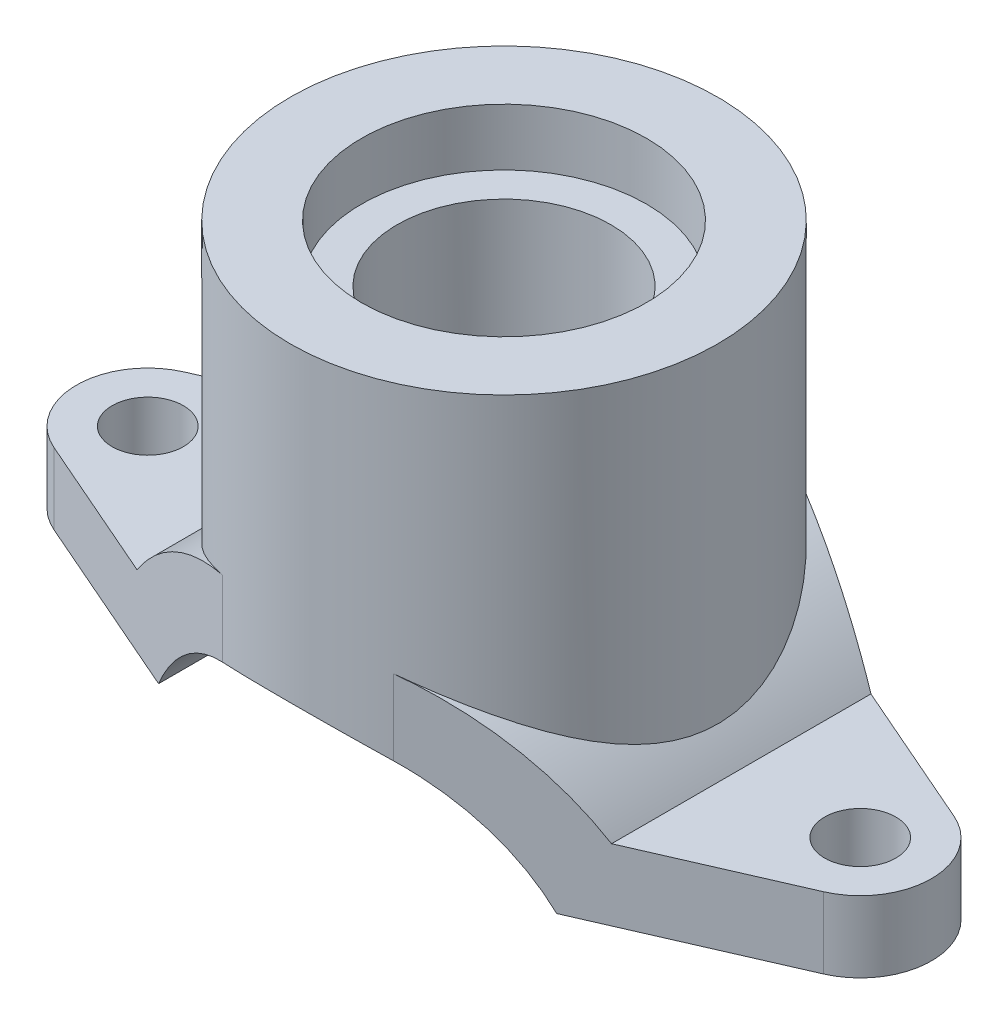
ISO-10303-21;
HEADER;
FILE_DESCRIPTION(('STEP AP214'),'2;1');
FILE_NAME('part.step','',(''),(''),'','','');
FILE_SCHEMA(('AUTOMOTIVE_DESIGN { 1 0 10303 214 1 1 1 1 }'));
ENDSEC;
DATA;
#1=APPLICATION_CONTEXT('core data for automotive mechanical design processes');
#2=APPLICATION_PROTOCOL_DEFINITION('international standard','automotive_design',2000,#1);
#3=PRODUCT_CONTEXT('',#1,'mechanical');
#4=PRODUCT('Part','Part','',(#3));
#5=PRODUCT_RELATED_PRODUCT_CATEGORY('part','',(#4));
#6=PRODUCT_DEFINITION_FORMATION('','',#4);
#7=PRODUCT_DEFINITION_CONTEXT('part definition',#1,'design');
#8=PRODUCT_DEFINITION('design','',#6,#7);
#9=PRODUCT_DEFINITION_SHAPE('','',#8);
#10=(LENGTH_UNIT() NAMED_UNIT(*) SI_UNIT(.MILLI.,.METRE.));
#11=(NAMED_UNIT(*) PLANE_ANGLE_UNIT() SI_UNIT($,.RADIAN.));
#12=(NAMED_UNIT(*) SI_UNIT($,.STERADIAN.) SOLID_ANGLE_UNIT());
#13=UNCERTAINTY_MEASURE_WITH_UNIT(LENGTH_MEASURE(1.E-05),#10,'distance_accuracy_value','');
#14=(GEOMETRIC_REPRESENTATION_CONTEXT(3) GLOBAL_UNCERTAINTY_ASSIGNED_CONTEXT((#13)) GLOBAL_UNIT_ASSIGNED_CONTEXT((#10,
#11,#12)) REPRESENTATION_CONTEXT('',''));
#15=CARTESIAN_POINT('',(0.,0.,0.));
#16=DIRECTION('',(0.,0.,1.));
#17=DIRECTION('',(1.,0.,0.));
#18=AXIS2_PLACEMENT_3D('',#15,#16,#17);
#19=CARTESIAN_POINT('',(0.,-39.,75.));
#20=DIRECTION('',(0.,0.,-1.));
#21=DIRECTION('',(-1.,0.,0.));
#22=AXIS2_PLACEMENT_3D('',#19,#20,#21);
#23=CYLINDRICAL_SURFACE('',#22,105.);
#24=CARTESIAN_POINT('',(0.,-39.,81.8317088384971));
#25=DIRECTION('',(-0.4,0.,0.916515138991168));
#26=DIRECTION('',(-0.916515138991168,0.,-0.4));
#27=AXIS2_PLACEMENT_3D('',#24,#25,#26);
#28=ELLIPSE('',#27,114.564392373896,105.);
#29=CARTESIAN_POINT('',(-30.,61.6230589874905,68.7386354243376));
#30=VERTEX_POINT('',#29);
#31=CARTESIAN_POINT('',(-83.240615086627,25.,45.502526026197));
#32=VERTEX_POINT('',#31);
#33=EDGE_CURVE('E273',#30,#32,#28,.T.);
#34=ORIENTED_EDGE('',*,*,#33,.F.);
#35=CARTESIAN_POINT('',(0.,66.,75.));
#36=CARTESIAN_POINT('',(-0.927941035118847,66.0000001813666,75.0000001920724));
#37=CARTESIAN_POINT('',(-1.85587713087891,65.9876926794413,74.9827726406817));
#38=CARTESIAN_POINT('',(-3.70991339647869,65.9385371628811,74.9139317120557));
#39=CARTESIAN_POINT('',(-4.6360133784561,65.9016867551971,74.8623149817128));
#40=CARTESIAN_POINT('',(-6.48425148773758,65.8036772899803,74.7249161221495));
#41=CARTESIAN_POINT('',(-7.40639014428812,65.7425215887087,74.6391387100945));
#42=CARTESIAN_POINT('',(-9.24508144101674,65.5962672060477,74.4337578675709));
#43=CARTESIAN_POINT('',(-10.1616334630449,65.5111659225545,74.3141507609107));
#44=CARTESIAN_POINT('',(-11.9874853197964,65.3175115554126,74.0415587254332));
#45=CARTESIAN_POINT('',(-12.8967833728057,65.2089528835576,73.888565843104));
#46=CARTESIAN_POINT('',(-14.7063098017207,64.9690220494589,73.5497916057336));
#47=CARTESIAN_POINT('',(-15.6065371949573,64.8376474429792,73.3640067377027));
#48=CARTESIAN_POINT('',(-17.3961496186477,64.5528602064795,72.9603680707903));
#49=CARTESIAN_POINT('',(-18.2855356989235,64.3994497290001,72.7425174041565));
#50=CARTESIAN_POINT('',(-20.0521720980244,64.0714202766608,72.2754820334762));
#51=CARTESIAN_POINT('',(-20.9294211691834,63.8967991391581,72.0262941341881));
#52=CARTESIAN_POINT('',(-22.6658131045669,63.5282615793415,71.4988101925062));
#53=CARTESIAN_POINT('',(-23.525026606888,63.3344507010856,71.2206729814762));
#54=CARTESIAN_POINT('',(-25.2288633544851,62.9277783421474,70.6350925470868));
#55=CARTESIAN_POINT('',(-26.0734852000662,62.7149150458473,70.3276465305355));
#56=CARTESIAN_POINT('',(-28.5835996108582,62.0493564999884,69.3627420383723));
#57=CARTESIAN_POINT('',(-30.2258008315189,61.5695941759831,68.6625768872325));
#58=CARTESIAN_POINT('',(-33.4398608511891,60.5470805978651,67.1559915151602));
#59=CARTESIAN_POINT('',(-35.0117209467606,60.0043305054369,66.3495732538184));
#60=CARTESIAN_POINT('',(-38.0800590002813,58.8651483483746,64.6374173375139));
#61=CARTESIAN_POINT('',(-39.5765332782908,58.2687136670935,63.7316748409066));
#62=CARTESIAN_POINT('',(-42.6205529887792,56.9763615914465,61.7420809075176));
#63=CARTESIAN_POINT('',(-44.1606639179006,56.2763187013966,60.6495426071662));
#64=CARTESIAN_POINT('',(-47.1427943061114,54.8365537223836,58.3617111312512));
#65=CARTESIAN_POINT('',(-48.5848090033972,54.0968297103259,57.1664129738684));
#66=CARTESIAN_POINT('',(-51.3698170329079,52.5895876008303,54.6775530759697));
#67=CARTESIAN_POINT('',(-52.7126705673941,51.822032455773,53.3838576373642));
#68=CARTESIAN_POINT('',(-55.2949626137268,50.2733621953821,50.7043317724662));
#69=CARTESIAN_POINT('',(-56.5343953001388,49.4922463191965,49.3184961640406));
#70=CARTESIAN_POINT('',(-58.4230617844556,48.2493755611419,47.0420640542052));
#71=CARTESIAN_POINT('',(-59.1068248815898,47.7873120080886,46.1800276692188));
#72=CARTESIAN_POINT('',(-60.436662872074,46.8665455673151,44.4254607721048));
#73=CARTESIAN_POINT('',(-61.0827357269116,46.4078428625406,43.5329286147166));
#74=CARTESIAN_POINT('',(-62.3366260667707,45.4970162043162,41.7176498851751));
#75=CARTESIAN_POINT('',(-62.9444315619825,45.0448943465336,40.7948939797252));
#76=CARTESIAN_POINT('',(-64.1206958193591,44.1509590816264,38.9199315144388));
#77=CARTESIAN_POINT('',(-64.6891587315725,43.7091445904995,37.9677280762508));
#78=CARTESIAN_POINT('',(-65.7852178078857,42.8400488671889,36.0352250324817));
#79=CARTESIAN_POINT('',(-66.3128603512,42.4127514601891,35.0549590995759));
#80=CARTESIAN_POINT('',(-67.3267922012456,41.5762705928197,33.0658399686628));
#81=CARTESIAN_POINT('',(-67.8130802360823,41.1670876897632,32.0569858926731));
#82=CARTESIAN_POINT('',(-69.2074984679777,39.9735181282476,28.9890473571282));
#83=CARTESIAN_POINT('',(-70.0520751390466,39.2223926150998,26.8870194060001));
#84=CARTESIAN_POINT('',(-71.3153717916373,38.0687870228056,23.2705420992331));
#85=CARTESIAN_POINT('',(-71.7837525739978,37.631803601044,21.7841612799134));
#86=CARTESIAN_POINT('',(-72.6309207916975,36.8293459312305,18.7670670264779));
#87=CARTESIAN_POINT('',(-73.0097225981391,36.4638602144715,17.2363607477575));
#88=CARTESIAN_POINT('',(-73.6720269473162,35.8174238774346,14.1398142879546));
#89=CARTESIAN_POINT('',(-73.9557033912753,35.536319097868,12.5740438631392));
#90=CARTESIAN_POINT('',(-74.4240240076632,35.0687161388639,9.41360032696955));
#91=CARTESIAN_POINT('',(-74.6086682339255,34.8822179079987,7.81892723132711));
#92=CARTESIAN_POINT('',(-74.8762122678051,34.6110718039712,4.60164472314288));
#93=CARTESIAN_POINT('',(-74.9584322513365,34.5271045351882,2.97892037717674));
#94=CARTESIAN_POINT('',(-75.0171122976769,34.4672356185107,-0.270408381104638));
#95=CARTESIAN_POINT('',(-74.9935756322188,34.4913306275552,-1.89701267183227));
#96=CARTESIAN_POINT('',(-74.8412098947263,34.6464858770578,-5.14124333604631));
#97=CARTESIAN_POINT('',(-74.7123059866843,34.7776221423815,-6.7588625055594));
#98=CARTESIAN_POINT('',(-74.3518022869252,35.1409082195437,-9.97109938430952));
#99=CARTESIAN_POINT('',(-74.1201908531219,35.3730694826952,-11.5657144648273));
#100=CARTESIAN_POINT('',(-73.5226204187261,35.9641422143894,-14.9228139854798));
#101=CARTESIAN_POINT('',(-73.1432797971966,36.3354559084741,-16.6807238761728));
#102=CARTESIAN_POINT('',(-72.2666607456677,37.1767521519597,-20.1424915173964));
#103=CARTESIAN_POINT('',(-71.7693642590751,37.6467498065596,-21.8463409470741));
#104=CARTESIAN_POINT('',(-70.6632073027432,38.6677425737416,-25.1957951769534));
#105=CARTESIAN_POINT('',(-70.0541444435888,39.2188842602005,-26.8412877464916));
#106=CARTESIAN_POINT('',(-68.7315212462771,40.3835871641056,-30.066875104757));
#107=CARTESIAN_POINT('',(-68.0179517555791,40.9971538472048,-31.6469641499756));
#108=CARTESIAN_POINT('',(-66.7551036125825,42.050480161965,-34.2057275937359));
#109=CARTESIAN_POINT('',(-66.2340297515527,42.4772095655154,-35.2038906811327));
#110=CARTESIAN_POINT('',(-65.1506116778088,43.3460976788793,-37.1706628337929));
#111=CARTESIAN_POINT('',(-64.5882686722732,43.7882559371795,-38.1392727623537));
#112=CARTESIAN_POINT('',(-63.4232155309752,44.6841439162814,-40.0467868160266));
#113=CARTESIAN_POINT('',(-62.8204940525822,45.137876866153,-40.985682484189));
#114=CARTESIAN_POINT('',(-61.5757055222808,46.0530966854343,-42.8330835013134));
#115=CARTESIAN_POINT('',(-60.9336391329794,46.5145834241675,-43.7415893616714));
#116=CARTESIAN_POINT('',(-59.6103462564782,47.4422355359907,-45.5284929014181));
#117=CARTESIAN_POINT('',(-58.929088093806,47.908404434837,-46.406865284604));
#118=CARTESIAN_POINT('',(-57.5285125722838,48.8417808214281,-48.1321597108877));
#119=CARTESIAN_POINT('',(-56.8091949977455,49.3089883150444,-48.9790815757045));
#120=CARTESIAN_POINT('',(-55.3331220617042,50.2412882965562,-50.6406992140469));
#121=CARTESIAN_POINT('',(-54.5763701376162,50.7063809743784,-51.4553979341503));
#122=CARTESIAN_POINT('',(-53.0258927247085,51.631504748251,-53.0517933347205));
#123=CARTESIAN_POINT('',(-52.2321679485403,52.0915359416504,-53.833490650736));
#124=CARTESIAN_POINT('',(-50.6001042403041,53.0082288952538,-55.3705565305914));
#125=CARTESIAN_POINT('',(-49.761398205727,53.4648108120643,-56.1255831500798));
#126=CARTESIAN_POINT('',(-48.0473363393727,54.3669718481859,-57.5997502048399));
#127=CARTESIAN_POINT('',(-47.1719810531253,54.812551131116,-58.318891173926));
#128=CARTESIAN_POINT('',(-45.3850572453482,55.6899545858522,-59.7200628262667));
#129=CARTESIAN_POINT('',(-44.4734814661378,56.1217759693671,-60.4020860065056));
#130=CARTESIAN_POINT('',(-42.6151617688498,56.9686953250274,-61.7272234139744));
#131=CARTESIAN_POINT('',(-41.668422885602,57.3837956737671,-62.3703431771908));
#132=CARTESIAN_POINT('',(-39.742265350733,58.1938369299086,-63.6149728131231));
#133=CARTESIAN_POINT('',(-38.762907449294,58.588812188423,-64.2165542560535));
#134=CARTESIAN_POINT('',(-36.7711735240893,59.3565950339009,-65.3774371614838));
#135=CARTESIAN_POINT('',(-35.7588019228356,59.7294055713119,-65.9367442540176));
#136=CARTESIAN_POINT('',(-33.7024890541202,60.4501318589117,-67.0110991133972));
#137=CARTESIAN_POINT('',(-32.6585552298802,60.7980534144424,-67.5261572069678));
#138=CARTESIAN_POINT('',(-30.540701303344,61.466406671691,-68.5100658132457));
#139=CARTESIAN_POINT('',(-29.4667836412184,61.7868406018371,-68.9789200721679));
#140=CARTESIAN_POINT('',(-26.7592494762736,62.5468848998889,-70.08567553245));
#141=CARTESIAN_POINT('',(-25.1083769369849,62.9682924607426,-70.6943400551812));
#142=CARTESIAN_POINT('',(-21.7524623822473,63.7365236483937,-71.7979816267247));
#143=CARTESIAN_POINT('',(-20.0474292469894,64.0833594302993,-72.2929772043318));
#144=CARTESIAN_POINT('',(-16.5935346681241,64.6953623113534,-73.1629947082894));
#145=CARTESIAN_POINT('',(-14.8446978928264,64.9605743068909,-73.5380825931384));
#146=CARTESIAN_POINT('',(-11.3138195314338,65.4038467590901,-74.1634135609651));
#147=CARTESIAN_POINT('',(-9.53177701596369,65.5819047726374,-74.4136531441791));
#148=CARTESIAN_POINT('',(-5.94177658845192,65.8472459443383,-74.7861094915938));
#149=CARTESIAN_POINT('',(-4.13375385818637,65.934235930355,-74.9079127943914));
#150=CARTESIAN_POINT('',(-0.511544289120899,66.0143797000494,-75.0201406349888));
#151=CARTESIAN_POINT('',(1.30264253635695,66.0075336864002,-75.0105654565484));
#152=CARTESIAN_POINT('',(4.92292171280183,65.9001659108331,-74.8601866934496));
#153=CARTESIAN_POINT('',(6.72901329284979,65.7996354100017,-74.7193708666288));
#154=CARTESIAN_POINT('',(10.318908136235,65.5072406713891,-74.3087082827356));
#155=CARTESIAN_POINT('',(12.1027118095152,65.3153781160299,-74.0388639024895));
#156=CARTESIAN_POINT('',(15.5506424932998,64.8559435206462,-73.3900996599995));
#157=CARTESIAN_POINT('',(17.2164157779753,64.5924261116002,-73.0170063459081));
#158=CARTESIAN_POINT('',(20.5061231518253,63.9917215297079,-72.1622279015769));
#159=CARTESIAN_POINT('',(22.1300589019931,63.6545372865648,-71.6805470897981));
#160=CARTESIAN_POINT('',(25.3278886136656,62.9126722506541,-70.6140178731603));
#161=CARTESIAN_POINT('',(26.9017782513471,62.5079856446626,-70.0291605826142));
#162=CARTESIAN_POINT('',(29.9925812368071,61.6380800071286,-68.7621642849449));
#163=CARTESIAN_POINT('',(31.5094912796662,61.172857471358,-68.0800196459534));
#164=CARTESIAN_POINT('',(34.6157999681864,60.1446430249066,-66.5582676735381));
#165=CARTESIAN_POINT('',(36.1992787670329,59.5766095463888,-65.7099875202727));
#166=CARTESIAN_POINT('',(39.2866049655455,58.3873701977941,-63.9120837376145));
#167=CARTESIAN_POINT('',(40.790448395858,57.7661616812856,-62.9624550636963));
#168=CARTESIAN_POINT('',(43.7155034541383,56.4804094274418,-60.9679451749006));
#169=CARTESIAN_POINT('',(45.1366631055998,55.8158389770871,-59.9230050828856));
#170=CARTESIAN_POINT('',(47.8924988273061,54.454113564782,-57.744216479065));
#171=CARTESIAN_POINT('',(49.2271704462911,53.7569569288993,-56.6103633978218));
#172=CARTESIAN_POINT('',(52.0415269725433,52.2123928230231,-54.0456392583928));
#173=CARTESIAN_POINT('',(53.5037222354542,51.3606330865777,-52.5981580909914));
#174=CARTESIAN_POINT('',(56.301358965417,49.6445180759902,-49.5920769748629));
#175=CARTESIAN_POINT('',(57.6367790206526,48.7801607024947,-48.0334583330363));
#176=CARTESIAN_POINT('',(60.1779704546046,47.0579387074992,-44.8087993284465));
#177=CARTESIAN_POINT('',(61.3836680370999,46.2000780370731,-43.1426986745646));
#178=CARTESIAN_POINT('',(63.6599613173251,44.5129646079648,-39.707109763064));
#179=CARTESIAN_POINT('',(64.7305808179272,43.6837068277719,-37.9376398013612));
#180=CARTESIAN_POINT('',(66.5754671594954,42.2027204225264,-34.5801213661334));
#181=CARTESIAN_POINT('',(67.369942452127,41.5434079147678,-33.006511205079));
#182=CARTESIAN_POINT('',(68.8531926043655,40.2791733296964,-29.7888506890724));
#183=CARTESIAN_POINT('',(69.5419684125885,39.674250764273,-28.1448009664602));
#184=CARTESIAN_POINT('',(70.8063703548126,38.5382449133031,-24.7923675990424));
#185=CARTESIAN_POINT('',(71.3821918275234,38.0070346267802,-23.0841012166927));
#186=CARTESIAN_POINT('',(72.4146398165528,37.0369825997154,-19.6063100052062));
#187=CARTESIAN_POINT('',(72.8712951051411,36.5981185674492,-17.8368000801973));
#188=CARTESIAN_POINT('',(73.5842932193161,35.903612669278,-14.580441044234));
#189=CARTESIAN_POINT('',(73.8621018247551,35.6290704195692,-13.1023106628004));
#190=CARTESIAN_POINT('',(74.3295447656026,35.1635230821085,-10.1191423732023));
#191=CARTESIAN_POINT('',(74.5191900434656,34.9725076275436,-8.61410782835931));
#192=CARTESIAN_POINT('',(74.8069701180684,34.6814726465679,-5.5879305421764));
#193=CARTESIAN_POINT('',(74.9051912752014,34.5813672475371,-4.06680437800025));
#194=CARTESIAN_POINT('',(75.0085984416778,34.4759537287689,-1.01804101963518));
#195=CARTESIAN_POINT('',(75.013783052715,34.4706470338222,0.509596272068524));
#196=CARTESIAN_POINT('',(74.9310092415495,34.5550624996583,3.55971126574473));
#197=CARTESIAN_POINT('',(74.8430484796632,34.6447870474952,5.08218883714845));
#198=CARTESIAN_POINT('',(74.5756446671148,34.9155536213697,8.11076906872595));
#199=CARTESIAN_POINT('',(74.3962019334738,35.0965953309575,9.61687178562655));
#200=CARTESIAN_POINT('',(73.9486197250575,35.543284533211,12.6050518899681));
#201=CARTESIAN_POINT('',(73.6803633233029,35.8090435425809,14.0870948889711));
#202=CARTESIAN_POINT('',(73.0591966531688,36.4157930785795,17.0175918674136));
#203=CARTESIAN_POINT('',(72.7062746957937,36.7567939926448,18.4660411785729));
#204=CARTESIAN_POINT('',(71.7867868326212,37.6301765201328,21.8081059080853));
#205=CARTESIAN_POINT('',(71.1883484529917,38.1882562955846,23.6862870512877));
#206=CARTESIAN_POINT('',(69.8571622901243,39.3950458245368,27.3643143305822));
#207=CARTESIAN_POINT('',(69.1243670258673,40.0437875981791,29.1641324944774));
#208=CARTESIAN_POINT('',(67.5319203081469,41.4085850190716,32.6829299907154));
#209=CARTESIAN_POINT('',(66.6721090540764,42.124725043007,34.4018038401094));
#210=CARTESIAN_POINT('',(64.8329718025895,43.6019182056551,37.7536790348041));
#211=CARTESIAN_POINT('',(63.8536548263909,44.3629679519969,39.3866868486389));
#212=CARTESIAN_POINT('',(61.7524531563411,45.9317344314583,42.6078754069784));
#213=CARTESIAN_POINT('',(60.6274444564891,46.7401556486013,44.1936722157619));
#214=CARTESIAN_POINT('',(58.2603611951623,48.3658513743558,47.2704719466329));
#215=CARTESIAN_POINT('',(57.018286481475,49.1831258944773,48.7614747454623));
#216=CARTESIAN_POINT('',(54.4196797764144,50.8100753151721,51.6455951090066));
#217=CARTESIAN_POINT('',(53.0631115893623,51.6197477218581,53.0386814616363));
#218=CARTESIAN_POINT('',(50.2381795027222,53.2158157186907,55.7218042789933));
#219=CARTESIAN_POINT('',(48.7698044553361,54.0022089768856,57.0118304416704));
#220=CARTESIAN_POINT('',(46.3553445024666,55.2187915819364,58.9703438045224));
#221=CARTESIAN_POINT('',(45.4447310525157,55.6616536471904,59.6750260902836));
#222=CARTESIAN_POINT('',(43.5870243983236,56.5312655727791,61.0450903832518));
#223=CARTESIAN_POINT('',(42.6399346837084,56.958016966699,61.7104761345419));
#224=CARTESIAN_POINT('',(40.7098221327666,57.7926459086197,63.0004617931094));
#225=CARTESIAN_POINT('',(39.7267879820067,58.2005174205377,63.6250486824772));
#226=CARTESIAN_POINT('',(37.7262841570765,58.9943124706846,64.8312536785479));
#227=CARTESIAN_POINT('',(36.7088195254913,59.3802392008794,65.4128780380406));
#228=CARTESIAN_POINT('',(34.6418328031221,60.1269364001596,66.5306114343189));
#229=CARTESIAN_POINT('',(33.5923485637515,60.4877350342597,67.0667715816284));
#230=CARTESIAN_POINT('',(31.4619911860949,61.1818241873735,68.0921455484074));
#231=CARTESIAN_POINT('',(30.3811226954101,61.5151187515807,68.5813662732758));
#232=CARTESIAN_POINT('',(28.1900707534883,62.1514756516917,69.5106874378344));
#233=CARTESIAN_POINT('',(27.0798942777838,62.4545451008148,69.9507994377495));
#234=CARTESIAN_POINT('',(24.8323470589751,63.02793375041,70.779862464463));
#235=CARTESIAN_POINT('',(23.6949784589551,63.298255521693,71.1688175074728));
#236=CARTESIAN_POINT('',(21.6475792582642,63.748370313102,71.8141256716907));
#237=CARTESIAN_POINT('',(20.7423108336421,63.9350242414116,72.0808639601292));
#238=CARTESIAN_POINT('',(18.9182962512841,64.2858191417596,72.5809355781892));
#239=CARTESIAN_POINT('',(17.9995506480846,64.4499610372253,72.8142702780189));
#240=CARTESIAN_POINT('',(16.1502870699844,64.7547410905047,73.2466368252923));
#241=CARTESIAN_POINT('',(15.2197706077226,64.8953822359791,73.4456730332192));
#242=CARTESIAN_POINT('',(13.3485741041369,65.152327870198,73.8086976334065));
#243=CARTESIAN_POINT('',(12.4078939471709,65.2686320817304,73.9726856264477));
#244=CARTESIAN_POINT('',(10.5189967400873,65.4760868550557,74.2648186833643));
#245=CARTESIAN_POINT('',(9.57078626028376,65.5672572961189,74.3929920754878));
#246=CARTESIAN_POINT('',(7.66806699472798,65.7239798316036,74.6131216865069));
#247=CARTESIAN_POINT('',(6.71355826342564,65.7895321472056,74.7050782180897));
#248=CARTESIAN_POINT('',(4.80027606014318,65.8945912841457,74.8523743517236));
#249=CARTESIAN_POINT('',(3.84150253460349,65.9340977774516,74.9077134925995));
#250=CARTESIAN_POINT('',(1.92181756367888,65.9868019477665,74.9815260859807));
#251=CARTESIAN_POINT('',(0.960906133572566,65.9999998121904,74.9999998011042));
#252=CARTESIAN_POINT('',(0.,66.,75.));
#253=B_SPLINE_CURVE_WITH_KNOTS('',3,(#35,#36,#37,#38,#39,#40,#41,#42,#43,#44,#45,#46,#47,#48,
#49,#50,#51,#52,#53,#54,#55,#56,#57,#58,#59,#60,#61,#62,#63,#64,#65,#66,#67,#68,#69,#70,#71,#72,
#73,#74,#75,#76,#77,#78,#79,#80,#81,#82,#83,#84,#85,#86,#87,#88,#89,#90,#91,#92,#93,#94,#95,#96,
#97,#98,#99,#100,#101,#102,#103,#104,#105,#106,#107,#108,#109,#110,#111,#112,#113,#114,#115,
#116,#117,#118,#119,#120,#121,#122,#123,#124,#125,#126,#127,#128,#129,#130,#131,#132,#133,#134,
#135,#136,#137,#138,#139,#140,#141,#142,#143,#144,#145,#146,#147,#148,#149,#150,#151,#152,#153,
#154,#155,#156,#157,#158,#159,#160,#161,#162,#163,#164,#165,#166,#167,#168,#169,#170,#171,#172,
#173,#174,#175,#176,#177,#178,#179,#180,#181,#182,#183,#184,#185,#186,#187,#188,#189,#190,#191,
#192,#193,#194,#195,#196,#197,#198,#199,#200,#201,#202,#203,#204,#205,#206,#207,#208,#209,#210,
#211,#212,#213,#214,#215,#216,#217,#218,#219,#220,#221,#222,#223,#224,#225,#226,#227,#228,#229,
#230,#231,#232,#233,#234,#235,#236,#237,#238,#239,#240,#241,#242,#243,#244,#245,#246,#247,#248,
#249,#250,#251,#252),.UNSPECIFIED.,.T.,.F.,(4,2,2,2,2,2,2,2,2,2,2,2,2,2,2,2,2,2,2,2,2,2,2,2,2,2,
2,2,2,2,2,2,2,2,2,2,2,2,2,2,2,2,2,2,2,2,2,2,2,2,2,2,2,2,2,2,2,2,2,2,2,2,2,2,2,2,2,2,2,2,2,2,2,2,
2,2,2,2,2,2,2,2,2,2,2,2,2,2,2,2,2,2,2,2,2,2,2,2,2,2,2,2,2,2,2,2,2,2,4),(0.,2.78357364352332,
5.56741873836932,8.35087955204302,11.1346429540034,13.9190702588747,16.7037960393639,
19.488249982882,22.27298806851,25.0431813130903,27.8136388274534,33.353086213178,
38.8924314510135,44.4320468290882,50.4679235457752,56.5040930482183,62.5486160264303,
68.5934792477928,72.1727428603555,75.7521998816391,79.3327728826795,82.9129676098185,
86.4890329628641,90.0652082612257,97.2117561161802,102.063453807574,106.914372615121,
111.75637435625,116.598373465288,121.472342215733,126.346160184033,131.223442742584,
136.10127829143,141.602168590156,147.103901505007,152.615697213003,158.12797592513,
161.739316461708,165.350551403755,168.962805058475,172.574997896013,176.190152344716,
179.805327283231,183.42017087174,187.034944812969,190.685908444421,194.336817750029,
197.988462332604,201.639586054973,205.284253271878,208.928434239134,212.571762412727,
216.214794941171,221.636596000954,227.057512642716,232.475442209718,237.893523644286,
243.328994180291,248.764452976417,254.200418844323,259.636284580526,264.812469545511,
269.988448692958,275.164873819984,280.341598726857,285.988253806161,291.635190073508,
297.285638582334,302.936377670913,309.610098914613,316.284945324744,322.963569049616,
329.641014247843,335.282598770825,340.924132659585,346.555822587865,352.186151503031,
356.768105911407,361.349491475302,365.926544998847,370.503667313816,375.080904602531,
379.658126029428,384.241397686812,388.825302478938,394.96219712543,401.101264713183,
407.248122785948,413.394517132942,419.706083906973,426.017658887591,432.331236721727,
438.645444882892,442.345334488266,446.0448710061,449.745582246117,453.44575381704,
457.141708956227,460.837119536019,464.531658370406,468.225906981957,471.111117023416,
473.996208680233,476.880933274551,479.76569072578,482.648159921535,485.530604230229,
488.413084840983,491.295544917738),.UNSPECIFIED.);
#254=CARTESIAN_POINT('',(-30.,61.6230589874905,-68.7386354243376));
#255=VERTEX_POINT('',#254);
#256=EDGE_CURVE('E12',#30,#255,#253,.T.);
#257=ORIENTED_EDGE('',*,*,#256,.T.);
#258=CARTESIAN_POINT('',(0.,-39.,-81.8317088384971));
#259=DIRECTION('',(-0.4,0.,-0.916515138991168));
#260=DIRECTION('',(0.916515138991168,0.,-0.4));
#261=AXIS2_PLACEMENT_3D('',#258,#259,#260);
#262=ELLIPSE('',#261,114.564392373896,105.);
#263=CARTESIAN_POINT('',(-83.240615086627,25.,-45.502526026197));
#264=VERTEX_POINT('',#263);
#265=EDGE_CURVE('E322',#264,#255,#262,.T.);
#266=ORIENTED_EDGE('',*,*,#265,.F.);
#267=DIRECTION('',(0.,0.,-1.));
#268=VECTOR('',#267,1.);
#269=CARTESIAN_POINT('',(-83.240615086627,25.,75.));
#270=LINE('',#269,#268);
#271=EDGE_CURVE('E277',#32,#264,#270,.T.);
#272=ORIENTED_EDGE('',*,*,#271,.F.);
#273=EDGE_LOOP('',(#34,#257,#266,#272));
#274=FACE_BOUND('',#273,.T.);
#275=ADVANCED_FACE('F33',(#274),#23,.T.);
#276=CARTESIAN_POINT('',(150.,0.,75.));
#277=DIRECTION('',(0.,1.,0.));
#278=DIRECTION('',(-1.,0.,0.));
#279=AXIS2_PLACEMENT_3D('',#276,#277,#278);
#280=PLANE('',#279);
#281=CARTESIAN_POINT('',(125.,0.,0.));
#282=DIRECTION('',(0.,1.,0.));
#283=DIRECTION('',(1.,0.,0.));
#284=AXIS2_PLACEMENT_3D('',#281,#282,#283);
#285=CIRCLE('',#284,12.5);
#286=CARTESIAN_POINT('',(137.5,0.,0.));
#287=VERTEX_POINT('',#286);
#288=EDGE_CURVE('E356',#287,#287,#285,.T.);
#289=ORIENTED_EDGE('',*,*,#288,.T.);
#290=EDGE_LOOP('',(#289));
#291=FACE_BOUND('',#290,.T.);
#292=DIRECTION('',(0.916515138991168,0.,-0.4));
#293=VECTOR('',#292,1.);
#294=CARTESIAN_POINT('',(135.,0.,22.9128784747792));
#295=LINE('',#294,#293);
#296=CARTESIAN_POINT('',(69.8498389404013,0.,51.3467398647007));
#297=VERTEX_POINT('',#296);
#298=CARTESIAN_POINT('',(135.,0.,22.9128784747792));
#299=VERTEX_POINT('',#298);
#300=EDGE_CURVE('E179',#297,#299,#295,.T.);
#301=ORIENTED_EDGE('',*,*,#300,.F.);
#302=DIRECTION('',(0.,0.,-1.));
#303=VECTOR('',#302,1.);
#304=CARTESIAN_POINT('',(69.8498389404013,0.,75.));
#305=LINE('',#304,#303);
#306=CARTESIAN_POINT('',(69.8498389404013,0.,-51.3467398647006));
#307=VERTEX_POINT('',#306);
#308=EDGE_CURVE('E299',#297,#307,#305,.T.);
#309=ORIENTED_EDGE('',*,*,#308,.T.);
#310=DIRECTION('',(-0.916515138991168,0.,-0.4));
#311=VECTOR('',#310,1.);
#312=CARTESIAN_POINT('',(135.,0.,-22.9128784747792));
#313=LINE('',#312,#311);
#314=CARTESIAN_POINT('',(135.,0.,-22.9128784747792));
#315=VERTEX_POINT('',#314);
#316=EDGE_CURVE('E317',#315,#307,#313,.T.);
#317=ORIENTED_EDGE('',*,*,#316,.F.);
#318=CARTESIAN_POINT('',(125.,0.,0.));
#319=DIRECTION('',(0.,1.,0.));
#320=DIRECTION('',(-1.,0.,0.));
#321=AXIS2_PLACEMENT_3D('',#318,#319,#320);
#322=CIRCLE('',#321,25.);
#323=EDGE_CURVE('E141',#299,#315,#322,.T.);
#324=ORIENTED_EDGE('',*,*,#323,.F.);
#325=EDGE_LOOP('',(#301,#309,#317,#324));
#326=FACE_BOUND('',#325,.T.);
#327=ADVANCED_FACE('F217',(#291,#326),#280,.F.);
#328=CARTESIAN_POINT('',(-69.8498389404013,0.,75.));
#329=DIRECTION('',(0.,1.,0.));
#330=DIRECTION('',(-1.,0.,0.));
#331=AXIS2_PLACEMENT_3D('',#328,#329,#330);
#332=PLANE('',#331);
#333=CARTESIAN_POINT('',(-125.,0.,0.));
#334=DIRECTION('',(0.,1.,0.));
#335=DIRECTION('',(-1.,0.,0.));
#336=AXIS2_PLACEMENT_3D('',#333,#334,#335);
#337=CIRCLE('',#336,12.5);
#338=CARTESIAN_POINT('',(-137.5,0.,0.));
#339=VERTEX_POINT('',#338);
#340=EDGE_CURVE('E352',#339,#339,#337,.T.);
#341=ORIENTED_EDGE('',*,*,#340,.T.);
#342=EDGE_LOOP('',(#341));
#343=FACE_BOUND('',#342,.T.);
#344=DIRECTION('',(0.916515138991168,0.,0.4));
#345=VECTOR('',#344,1.);
#346=CARTESIAN_POINT('',(-30.,0.,68.7386354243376));
#347=LINE('',#346,#345);
#348=CARTESIAN_POINT('',(-135.,0.,22.9128784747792));
#349=VERTEX_POINT('',#348);
#350=CARTESIAN_POINT('',(-69.8498389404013,0.,51.3467398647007));
#351=VERTEX_POINT('',#350);
#352=EDGE_CURVE('E311',#349,#351,#347,.T.);
#353=ORIENTED_EDGE('',*,*,#352,.F.);
#354=CARTESIAN_POINT('',(-125.,0.,0.));
#355=DIRECTION('',(0.,1.,0.));
#356=DIRECTION('',(-1.,0.,0.));
#357=AXIS2_PLACEMENT_3D('',#354,#355,#356);
#358=CIRCLE('',#357,25.);
#359=CARTESIAN_POINT('',(-135.,0.,-22.9128784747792));
#360=VERTEX_POINT('',#359);
#361=EDGE_CURVE('E312',#360,#349,#358,.T.);
#362=ORIENTED_EDGE('',*,*,#361,.F.);
#363=DIRECTION('',(-0.916515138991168,0.,0.4));
#364=VECTOR('',#363,1.);
#365=CARTESIAN_POINT('',(-135.,0.,-22.9128784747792));
#366=LINE('',#365,#364);
#367=CARTESIAN_POINT('',(-69.8498389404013,0.,-51.3467398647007));
#368=VERTEX_POINT('',#367);
#369=EDGE_CURVE('E316',#368,#360,#366,.T.);
#370=ORIENTED_EDGE('',*,*,#369,.F.);
#371=DIRECTION('',(0.,0.,-1.));
#372=VECTOR('',#371,1.);
#373=CARTESIAN_POINT('',(-69.8498389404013,0.,75.));
#374=LINE('',#373,#372);
#375=EDGE_CURVE('E293',#351,#368,#374,.T.);
#376=ORIENTED_EDGE('',*,*,#375,.F.);
#377=EDGE_LOOP('',(#353,#362,#370,#376));
#378=FACE_BOUND('',#377,.T.);
#379=ADVANCED_FACE('F214',(#343,#378),#332,.F.);
#380=CARTESIAN_POINT('',(0.,-39.,75.));
#381=DIRECTION('',(0.,0.,-1.));
#382=DIRECTION('',(-1.,0.,0.));
#383=AXIS2_PLACEMENT_3D('',#380,#381,#382);
#384=CYLINDRICAL_SURFACE('',#383,80.);
#385=CARTESIAN_POINT('',(0.,41.,-37.5));
#386=CARTESIAN_POINT('',(-0.993424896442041,40.9999942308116,-37.499993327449));
#387=CARTESIAN_POINT('',(-1.98702581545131,40.9814491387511,-37.4604750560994));
#388=CARTESIAN_POINT('',(-3.96700469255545,40.9077297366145,-37.3028148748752));
#389=CARTESIAN_POINT('',(-4.95337867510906,40.8525366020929,-37.1846325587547));
#390=CARTESIAN_POINT('',(-6.91303888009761,40.706819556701,-36.8706720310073));
#391=CARTESIAN_POINT('',(-7.88629567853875,40.6162266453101,-36.6747422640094));
#392=CARTESIAN_POINT('',(-9.81065263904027,40.4020679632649,-36.2074779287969));
#393=CARTESIAN_POINT('',(-10.7617554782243,40.2785061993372,-35.9361525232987));
#394=CARTESIAN_POINT('',(-12.6321460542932,40.0020212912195,-35.3220075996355));
#395=CARTESIAN_POINT('',(-13.5515391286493,39.8492092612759,-34.9794582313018));
#396=CARTESIAN_POINT('',(-15.3567185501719,39.5175999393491,-34.2254016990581));
#397=CARTESIAN_POINT('',(-16.242503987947,39.3388019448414,-33.8138926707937));
#398=CARTESIAN_POINT('',(-17.9753922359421,38.9594244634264,-32.9254179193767));
#399=CARTESIAN_POINT('',(-18.8225052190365,38.7588507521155,-32.4484695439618));
#400=CARTESIAN_POINT('',(-20.4741173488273,38.3403931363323,-31.4324779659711));
#401=CARTESIAN_POINT('',(-21.2786151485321,38.1225086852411,-30.893432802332));
#402=CARTESIAN_POINT('',(-22.884365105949,37.6618636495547,-29.725326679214));
#403=CARTESIAN_POINT('',(-23.6829981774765,37.4183939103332,-29.0929431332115));
#404=CARTESIAN_POINT('',(-25.2248095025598,36.9234137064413,-27.7667644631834));
#405=CARTESIAN_POINT('',(-25.9679859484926,36.6719029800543,-27.0729673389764));
#406=CARTESIAN_POINT('',(-27.3958010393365,36.1667732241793,-25.627186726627));
#407=CARTESIAN_POINT('',(-28.0804031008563,35.913152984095,-24.8751674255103));
#408=CARTESIAN_POINT('',(-29.0601473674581,35.5361014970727,-23.7068822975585));
#409=CARTESIAN_POINT('',(-29.3788818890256,35.4109754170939,-23.3107263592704));
#410=CARTESIAN_POINT('',(-30.0003457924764,35.1626000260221,-22.5052896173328));
#411=CARTESIAN_POINT('',(-30.3030704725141,35.0393512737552,-22.09600501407));
#412=CARTESIAN_POINT('',(-31.2252500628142,34.6576214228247,-20.7945277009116));
#413=CARTESIAN_POINT('',(-31.815490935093,34.4039264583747,-19.87995031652));
#414=CARTESIAN_POINT('',(-32.9162523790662,33.9169586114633,-17.9988222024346));
#415=CARTESIAN_POINT('',(-33.4267775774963,33.6836845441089,-17.0322744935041));
#416=CARTESIAN_POINT('',(-34.1292066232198,33.3551240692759,-15.5482138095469));
#417=CARTESIAN_POINT('',(-34.3527845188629,33.2491649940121,-15.047834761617));
#418=CARTESIAN_POINT('',(-34.7782812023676,33.0453108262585,-14.0364522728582));
#419=CARTESIAN_POINT('',(-34.9802055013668,32.9474136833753,-13.5254515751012));
#420=CARTESIAN_POINT('',(-35.3618799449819,32.7605924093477,-12.4935994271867));
#421=CARTESIAN_POINT('',(-35.5416295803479,32.6716684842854,-11.9727477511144));
#422=CARTESIAN_POINT('',(-35.8784072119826,32.5036727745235,-10.9221937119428));
#423=CARTESIAN_POINT('',(-36.0354340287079,32.4246015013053,-10.3924908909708));
#424=CARTESIAN_POINT('',(-36.4553073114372,32.2116983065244,-8.85153754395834));
#425=CARTESIAN_POINT('',(-36.6884170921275,32.0915316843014,-7.83005352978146));
#426=CARTESIAN_POINT('',(-37.0687044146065,31.8939852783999,-5.76726337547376));
#427=CARTESIAN_POINT('',(-37.215885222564,31.816603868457,-4.72595799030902));
#428=CARTESIAN_POINT('',(-37.4222204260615,31.7077869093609,-2.63292684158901));
#429=CARTESIAN_POINT('',(-37.4814344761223,31.6763202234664,-1.58120862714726));
#430=CARTESIAN_POINT('',(-37.5111108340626,31.6605756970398,0.523783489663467));
#431=CARTESIAN_POINT('',(-37.4815799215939,31.6762942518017,1.57705726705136));
#432=CARTESIAN_POINT('',(-37.3417818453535,31.7502403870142,3.56842468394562));
#433=CARTESIAN_POINT('',(-37.2400630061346,31.8039653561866,4.50730155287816));
#434=CARTESIAN_POINT('',(-36.9666841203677,31.9470793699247,6.37197603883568));
#435=CARTESIAN_POINT('',(-36.7950296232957,32.0364655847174,7.29777468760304));
#436=CARTESIAN_POINT('',(-36.3836145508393,32.2480593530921,9.13043388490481));
#437=CARTESIAN_POINT('',(-36.1438404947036,32.3702734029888,10.0372906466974));
#438=CARTESIAN_POINT('',(-35.5985823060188,32.6437985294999,11.8264869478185));
#439=CARTESIAN_POINT('',(-35.2930950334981,32.7951109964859,12.7088253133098));
#440=CARTESIAN_POINT('',(-34.6112591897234,33.1263305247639,14.4643547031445));
#441=CARTESIAN_POINT('',(-34.2334412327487,33.3068156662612,15.3368675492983));
#442=CARTESIAN_POINT('',(-33.6195730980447,33.5932174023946,16.6192379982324));
#443=CARTESIAN_POINT('',(-33.4070824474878,33.6913019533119,17.0423142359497));
#444=CARTESIAN_POINT('',(-32.9666849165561,33.8920865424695,17.8793553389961));
#445=CARTESIAN_POINT('',(-32.738775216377,33.9947874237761,18.2933185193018));
#446=CARTESIAN_POINT('',(-32.0324309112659,34.3088600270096,19.520880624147));
#447=CARTESIAN_POINT('',(-31.5314069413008,34.5261895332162,20.3200982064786));
#448=CARTESIAN_POINT('',(-30.472144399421,34.9714701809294,21.8765796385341));
#449=CARTESIAN_POINT('',(-29.9139017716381,35.1994220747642,22.6338405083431));
#450=CARTESIAN_POINT('',(-29.0036749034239,35.5580902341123,23.7762209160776));
#451=CARTESIAN_POINT('',(-28.6704407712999,35.6869401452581,24.1769980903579));
#452=CARTESIAN_POINT('',(-27.9877817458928,35.9454287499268,24.964082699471));
#453=CARTESIAN_POINT('',(-27.6383603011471,36.0750672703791,25.350393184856));
#454=CARTESIAN_POINT('',(-26.5663006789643,36.4639604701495,26.4871004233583));
#455=CARTESIAN_POINT('',(-25.8198457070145,36.7232013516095,27.2152999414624));
#456=CARTESIAN_POINT('',(-24.2673813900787,37.2349168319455,28.6082585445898));
#457=CARTESIAN_POINT('',(-23.4613502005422,37.4873889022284,29.2729941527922));
#458=CARTESIAN_POINT('',(-21.7939808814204,37.9790732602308,30.5346559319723));
#459=CARTESIAN_POINT('',(-20.9326426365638,38.2182855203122,31.1315819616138));
#460=CARTESIAN_POINT('',(-19.1269646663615,38.6856490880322,32.2736963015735));
#461=CARTESIAN_POINT('',(-18.1807456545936,38.9130818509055,32.8162138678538));
#462=CARTESIAN_POINT('',(-16.2396299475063,39.3406788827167,33.8188950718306));
#463=CARTESIAN_POINT('',(-15.2447314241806,39.5408421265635,34.2790556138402));
#464=CARTESIAN_POINT('',(-13.2136974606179,39.9079362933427,35.1119944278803));
#465=CARTESIAN_POINT('',(-12.177585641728,40.0748859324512,35.4848219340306));
#466=CARTESIAN_POINT('',(-10.0715919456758,40.3706065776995,36.1390155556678));
#467=CARTESIAN_POINT('',(-9.00171343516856,40.4993813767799,36.4203907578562));
#468=CARTESIAN_POINT('',(-6.91920815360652,40.7065575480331,36.8703402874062));
#469=CARTESIAN_POINT('',(-5.90838032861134,40.7880348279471,37.0458425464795));
#470=CARTESIAN_POINT('',(-3.8734126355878,40.9126743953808,37.3135316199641));
#471=CARTESIAN_POINT('',(-2.84927343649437,40.9558386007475,37.4057226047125));
#472=CARTESIAN_POINT('',(-0.796326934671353,41.0026235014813,37.505622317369));
#473=CARTESIAN_POINT('',(0.232478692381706,41.0062574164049,37.5133592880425));
#474=CARTESIAN_POINT('',(2.28660413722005,40.9739107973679,37.4443235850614));
#475=CARTESIAN_POINT('',(3.3119240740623,40.9379316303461,37.367553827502));
#476=CARTESIAN_POINT('',(5.28307082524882,40.8310596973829,37.1383564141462));
#477=CARTESIAN_POINT('',(6.22966107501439,40.7626398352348,36.9912822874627));
#478=CARTESIAN_POINT('',(8.10602415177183,40.5938414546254,36.6258904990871));
#479=CARTESIAN_POINT('',(9.03579790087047,40.4934646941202,36.4075767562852));
#480=CARTESIAN_POINT('',(10.8726292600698,40.2631242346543,35.9018591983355));
#481=CARTESIAN_POINT('',(11.7796854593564,40.1331587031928,35.6144511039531));
#482=CARTESIAN_POINT('',(13.5656565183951,39.8466300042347,34.9731798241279));
#483=CARTESIAN_POINT('',(14.4445702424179,39.6900657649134,34.6193139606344));
#484=CARTESIAN_POINT('',(16.1957761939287,39.3486870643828,33.8362921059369));
#485=CARTESIAN_POINT('',(17.0670483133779,39.1631564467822,33.4051684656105));
#486=CARTESIAN_POINT('',(18.77002050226,38.7717803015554,32.4788546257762));
#487=CARTESIAN_POINT('',(19.6017201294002,38.5659345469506,31.9836637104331));
#488=CARTESIAN_POINT('',(21.2218565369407,38.1384144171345,30.9324358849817));
#489=CARTESIAN_POINT('',(22.0102780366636,37.916734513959,30.3763776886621));
#490=CARTESIAN_POINT('',(23.5400112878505,37.4624398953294,29.2069349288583));
#491=CARTESIAN_POINT('',(24.281320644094,37.2298246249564,28.5935474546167));
#492=CARTESIAN_POINT('',(25.777152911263,36.7377825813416,27.255860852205));
#493=CARTESIAN_POINT('',(26.5270348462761,36.4778054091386,26.5265501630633));
#494=CARTESIAN_POINT('',(27.6040096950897,36.0877130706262,25.3878274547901));
#495=CARTESIAN_POINT('',(27.9550488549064,35.9576523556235,25.0007659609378));
#496=CARTESIAN_POINT('',(28.6408681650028,35.6982936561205,24.212059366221));
#497=CARTESIAN_POINT('',(28.975644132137,35.5689958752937,23.8104105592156));
#498=CARTESIAN_POINT('',(29.9549250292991,35.1835201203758,22.5842190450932));
#499=CARTESIAN_POINT('',(30.5742544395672,34.9298067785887,21.7385671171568));
#500=CARTESIAN_POINT('',(31.7415760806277,34.4361908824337,19.9955588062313));
#501=CARTESIAN_POINT('',(32.2895711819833,34.1962877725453,19.0982045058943));
#502=CARTESIAN_POINT('',(33.0635656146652,33.848364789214,17.7016040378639));
#503=CARTESIAN_POINT('',(33.3172356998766,33.7326178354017,17.2194415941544));
#504=CARTESIAN_POINT('',(33.8038311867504,33.5077428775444,16.2434091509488));
#505=CARTESIAN_POINT('',(34.0367614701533,33.3986133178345,15.749541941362));
#506=CARTESIAN_POINT('',(34.7037192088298,33.0825522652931,14.2512002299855));
#507=CARTESIAN_POINT('',(35.1059633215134,32.886925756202,13.2298959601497));
#508=CARTESIAN_POINT('',(35.8205213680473,32.5335531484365,11.1511165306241));
#509=CARTESIAN_POINT('',(36.1329189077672,32.3757718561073,10.0936760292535));
#510=CARTESIAN_POINT('',(36.6642360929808,32.1043117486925,7.94999942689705));
#511=CARTESIAN_POINT('',(36.8831679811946,31.9906271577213,6.86376711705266));
#512=CARTESIAN_POINT('',(37.2088538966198,31.8204183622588,4.77162438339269));
#513=CARTESIAN_POINT('',(37.3239753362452,31.7596480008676,3.76735486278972));
#514=CARTESIAN_POINT('',(37.4727243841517,31.6809887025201,1.75113324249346));
#515=CARTESIAN_POINT('',(37.5063571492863,31.663097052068,0.739181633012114));
#516=CARTESIAN_POINT('',(37.4916662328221,31.6708920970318,-1.28368947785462));
#517=CARTESIAN_POINT('',(37.4433629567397,31.6965679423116,-2.2946091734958));
#518=CARTESIAN_POINT('',(37.265508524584,31.790479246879,-4.30724829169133));
#519=CARTESIAN_POINT('',(37.1359593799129,31.858713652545,-5.30896794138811));
#520=CARTESIAN_POINT('',(36.8099469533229,32.0285767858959,-7.22133544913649));
#521=CARTESIAN_POINT('',(36.6191740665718,32.1273458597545,-8.13321760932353));
#522=CARTESIAN_POINT('',(36.1715151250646,32.3560411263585,-9.93652414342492));
#523=CARTESIAN_POINT('',(35.9146332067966,32.4859653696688,-10.8279497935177));
#524=CARTESIAN_POINT('',(35.3370987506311,32.773207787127,-12.5855226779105));
#525=CARTESIAN_POINT('',(35.0164325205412,32.9305318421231,-13.4516644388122));
#526=CARTESIAN_POINT('',(34.3139901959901,33.2682631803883,-15.1541476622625));
#527=CARTESIAN_POINT('',(33.9322103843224,33.448671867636,-15.9904873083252));
#528=CARTESIAN_POINT('',(33.0829683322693,33.8405800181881,-17.6839766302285));
#529=CARTESIAN_POINT('',(32.6115015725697,34.0533481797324,-18.5388246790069));
#530=CARTESIAN_POINT('',(31.6054192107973,34.4942109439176,-20.2063309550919));
#531=CARTESIAN_POINT('',(31.0708016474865,34.7223060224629,-21.0189878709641));
#532=CARTESIAN_POINT('',(29.941352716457,35.1881973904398,-22.5988642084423));
#533=CARTESIAN_POINT('',(29.346497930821,35.4259974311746,-23.3660657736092));
#534=CARTESIAN_POINT('',(28.0998104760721,35.9055854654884,-24.8513755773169));
#535=CARTESIAN_POINT('',(27.4479750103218,36.1473736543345,-25.5694814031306));
#536=CARTESIAN_POINT('',(26.0212678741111,36.6539704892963,-27.0237668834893));
#537=CARTESIAN_POINT('',(25.2406254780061,36.918618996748,-27.75435476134));
#538=CARTESIAN_POINT('',(23.618021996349,37.4389622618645,-29.1476009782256));
#539=CARTESIAN_POINT('',(22.7760562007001,37.6946563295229,-29.8102540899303));
#540=CARTESIAN_POINT('',(21.034892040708,38.1903683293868,-31.0633922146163));
#541=CARTESIAN_POINT('',(20.1356628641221,38.4303776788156,-31.6538378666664));
#542=CARTESIAN_POINT('',(18.2855651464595,38.8880347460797,-32.7574129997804));
#543=CARTESIAN_POINT('',(17.3347002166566,39.1056840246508,-33.2705478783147));
#544=CARTESIAN_POINT('',(15.3917237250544,39.5116240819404,-34.2126441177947));
#545=CARTESIAN_POINT('',(14.3998240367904,39.7000464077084,-34.6419850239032));
#546=CARTESIAN_POINT('',(12.3773221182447,40.0433669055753,-35.4150235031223));
#547=CARTESIAN_POINT('',(11.3467140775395,40.1982600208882,-35.7587081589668));
#548=CARTESIAN_POINT('',(9.25763371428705,40.4695087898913,-36.3555127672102));
#549=CARTESIAN_POINT('',(8.19924235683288,40.5859653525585,-36.6088700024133));
#550=CARTESIAN_POINT('',(6.06131270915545,40.7772567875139,-37.0228933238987));
#551=CARTESIAN_POINT('',(4.98178884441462,40.8521190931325,-37.1836205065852));
#552=CARTESIAN_POINT('',(3.24989808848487,40.9365883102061,-37.3645732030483));
#553=CARTESIAN_POINT('',(2.60123728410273,40.960340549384,-37.4153300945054));
#554=CARTESIAN_POINT('',(1.30174287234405,40.9920484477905,-37.4830460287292));
#555=CARTESIAN_POINT('',(0.650909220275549,41.0000037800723,-37.5000043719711));
#556=CARTESIAN_POINT('',(0.,41.,-37.5));
#557=B_SPLINE_CURVE_WITH_KNOTS('',3,(#385,#386,#387,#388,#389,#390,#391,#392,#393,#394,#395,
#396,#397,#398,#399,#400,#401,#402,#403,#404,#405,#406,#407,#408,#409,#410,#411,#412,#413,#414,
#415,#416,#417,#418,#419,#420,#421,#422,#423,#424,#425,#426,#427,#428,#429,#430,#431,#432,#433,
#434,#435,#436,#437,#438,#439,#440,#441,#442,#443,#444,#445,#446,#447,#448,#449,#450,#451,#452,
#453,#454,#455,#456,#457,#458,#459,#460,#461,#462,#463,#464,#465,#466,#467,#468,#469,#470,#471,
#472,#473,#474,#475,#476,#477,#478,#479,#480,#481,#482,#483,#484,#485,#486,#487,#488,#489,#490,
#491,#492,#493,#494,#495,#496,#497,#498,#499,#500,#501,#502,#503,#504,#505,#506,#507,#508,#509,
#510,#511,#512,#513,#514,#515,#516,#517,#518,#519,#520,#521,#522,#523,#524,#525,#526,#527,#528,
#529,#530,#531,#532,#533,#534,#535,#536,#537,#538,#539,#540,#541,#542,#543,#544,#545,#546,#547,
#548,#549,#550,#551,#552,#553,#554,#555,#556),.UNSPECIFIED.,.T.,.F.,(4,2,2,2,2,2,2,2,2,2,2,2,2,
2,2,2,2,2,2,2,2,2,2,2,2,2,2,2,2,2,2,2,2,2,2,2,2,2,2,2,2,2,2,2,2,2,2,2,2,2,2,2,2,2,2,2,2,2,2,2,2,
2,2,2,2,2,2,2,2,2,2,2,2,2,2,2,2,2,2,2,2,2,2,2,2,4),(0.,2.97962709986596,5.96078588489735,
8.94778470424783,11.9344206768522,14.9099286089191,17.8855169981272,20.8603180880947,
23.8352131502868,26.9739533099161,30.1127957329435,33.2535844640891,34.8241161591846,
36.3951065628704,39.743750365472,43.0921997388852,44.7663314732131,46.4400361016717,
48.1137791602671,49.7876090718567,52.9466577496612,56.1055863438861,59.2623717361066,
62.4189159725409,65.2532748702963,68.0874089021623,70.9221041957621,73.7569349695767,
76.6570256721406,78.1072070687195,79.5576543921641,82.4587315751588,85.3600145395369,
86.9703354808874,88.5803149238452,91.8001674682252,95.0212065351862,98.2422523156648,
101.580428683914,104.918730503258,108.255145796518,111.591229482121,114.674708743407,
117.75803364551,120.840327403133,123.922514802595,126.800354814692,129.678036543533,
132.555896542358,135.433872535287,138.399652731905,141.365466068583,144.332319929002,
147.299324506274,150.529015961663,152.144081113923,153.75955950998,156.9910930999,
160.222496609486,161.892945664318,163.563000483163,166.902796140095,170.239473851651,
173.575714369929,176.609637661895,179.643368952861,182.676344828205,185.709245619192,
188.516678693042,191.323936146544,194.131796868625,196.939828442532,199.934189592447,
202.928643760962,205.924266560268,208.920036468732,212.220536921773,215.521291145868,
218.823836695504,222.12615157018,225.413142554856,228.700628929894,231.979414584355,
235.256035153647,237.208298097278,239.16060144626),.UNSPECIFIED.);
#558=CARTESIAN_POINT('',(0.,41.,-37.5));
#559=VERTEX_POINT('',#558);
#560=EDGE_CURVE('E38',#559,#559,#557,.T.);
#561=ORIENTED_EDGE('',*,*,#560,.T.);
#562=EDGE_LOOP('',(#561));
#563=FACE_BOUND('',#562,.T.);
#564=CARTESIAN_POINT('',(0.,-39.,81.8317088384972));
#565=DIRECTION('',(0.4,0.,0.916515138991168));
#566=DIRECTION('',(0.916515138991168,0.,-0.4));
#567=AXIS2_PLACEMENT_3D('',#564,#565,#566);
#568=ELLIPSE('',#567,87.2871560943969,80.);
#569=CARTESIAN_POINT('',(30.,35.1619848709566,68.7386354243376));
#570=VERTEX_POINT('',#569);
#571=EDGE_CURVE('E291',#570,#297,#568,.F.);
#572=ORIENTED_EDGE('',*,*,#571,.F.);
#573=CARTESIAN_POINT('',(-30.,35.1619848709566,68.7386354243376));
#574=CARTESIAN_POINT('',(-29.3003452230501,35.4450166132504,69.0439963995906));
#575=CARTESIAN_POINT('',(-28.5931194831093,35.7195746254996,69.3399312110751));
#576=CARTESIAN_POINT('',(-27.1640794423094,36.2508716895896,69.9121235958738));
#577=CARTESIAN_POINT('',(-26.4422637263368,36.5076090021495,70.1883792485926));
#578=CARTESIAN_POINT('',(-24.9842189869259,37.002512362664,70.7205164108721));
#579=CARTESIAN_POINT('',(-24.2479801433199,37.24066516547,70.976383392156));
#580=CARTESIAN_POINT('',(-22.7624474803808,37.6972951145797,71.4666567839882));
#581=CARTESIAN_POINT('',(-22.0131540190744,37.9157727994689,71.7010637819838));
#582=CARTESIAN_POINT('',(-19.7437088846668,38.5412811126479,72.3717933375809));
#583=CARTESIAN_POINT('',(-18.2047847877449,38.9174344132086,72.774600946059));
#584=CARTESIAN_POINT('',(-15.0866510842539,39.5807454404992,73.4843485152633));
#585=CARTESIAN_POINT('',(-13.5074512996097,39.867924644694,73.7913116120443));
#586=CARTESIAN_POINT('',(-10.3113417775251,40.349220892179,74.3054984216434));
#587=CARTESIAN_POINT('',(-8.69429503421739,40.5429162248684,74.5122701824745));
#588=CARTESIAN_POINT('',(-5.44124550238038,40.8314433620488,74.8201994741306));
#589=CARTESIAN_POINT('',(-3.80524125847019,40.9262675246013,74.9213488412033));
#590=CARTESIAN_POINT('',(-0.530097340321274,41.0149868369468,75.0159875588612));
#591=CARTESIAN_POINT('',(1.10903260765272,41.0090494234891,75.0096555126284));
#592=CARTESIAN_POINT('',(4.37978944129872,40.8967754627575,74.8898869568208));
#593=CARTESIAN_POINT('',(6.01141691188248,40.7904468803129,74.7764589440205));
#594=CARTESIAN_POINT('',(9.1676189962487,40.4879395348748,74.4535795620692));
#595=CARTESIAN_POINT('',(10.6932513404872,40.2968713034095,74.2495892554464));
#596=CARTESIAN_POINT('',(13.716554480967,39.8301705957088,73.7509559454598));
#597=CARTESIAN_POINT('',(15.2142233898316,39.5545324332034,73.4563068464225));
#598=CARTESIAN_POINT('',(18.1728428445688,38.9232736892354,72.7808423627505));
#599=CARTESIAN_POINT('',(19.6337892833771,38.5676442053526,72.4000173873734));
#600=CARTESIAN_POINT('',(22.5111508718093,37.78197199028,71.5576292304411));
#601=CARTESIAN_POINT('',(23.9275810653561,37.3519547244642,71.0960936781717));
#602=CARTESIAN_POINT('',(26.1169886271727,36.6215008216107,70.310898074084));
#603=CARTESIAN_POINT('',(26.9068373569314,36.3439811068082,70.0123474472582));
#604=CARTESIAN_POINT('',(28.4673997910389,35.7682897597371,69.3924367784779));
#605=CARTESIAN_POINT('',(29.2381554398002,35.4701701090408,69.0711341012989));
#606=CARTESIAN_POINT('',(30.,35.1619848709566,68.7386354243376));
#607=B_SPLINE_CURVE_WITH_KNOTS('',3,(#573,#574,#575,#576,#577,#578,#579,#580,#581,#582,#583,
#584,#585,#586,#587,#588,#589,#590,#591,#592,#593,#594,#595,#596,#597,#598,#599,#600,#601,#602,
#603,#604,#605,#606),.UNSPECIFIED.,.F.,.F.,(4,2,2,2,2,2,2,2,2,2,2,2,2,2,2,2,4),(0.,
2.44240296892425,4.88504397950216,7.32941025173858,9.77370959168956,14.6716503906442,
19.5684079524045,24.4870532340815,29.4060786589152,34.3169308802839,39.2273935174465,
43.8751848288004,48.5232887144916,53.1719101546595,57.8189433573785,60.4847624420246,
63.1440843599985),.UNSPECIFIED.);
#608=CARTESIAN_POINT('',(-30.,35.1619848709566,68.7386354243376));
#609=VERTEX_POINT('',#608);
#610=EDGE_CURVE('E157',#609,#570,#607,.T.);
#611=ORIENTED_EDGE('',*,*,#610,.F.);
#612=CARTESIAN_POINT('',(0.,-39.,81.8317088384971));
#613=DIRECTION('',(-0.4,0.,0.916515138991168));
#614=DIRECTION('',(-0.916515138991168,0.,-0.4));
#615=AXIS2_PLACEMENT_3D('',#612,#613,#614);
#616=ELLIPSE('',#615,87.2871560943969,80.);
#617=EDGE_CURVE('E279',#351,#609,#616,.F.);
#618=ORIENTED_EDGE('',*,*,#617,.F.);
#619=ORIENTED_EDGE('',*,*,#375,.T.);
#620=CARTESIAN_POINT('',(0.,-39.,-81.8317088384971));
#621=DIRECTION('',(-0.4,0.,-0.916515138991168));
#622=DIRECTION('',(0.916515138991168,0.,-0.4));
#623=AXIS2_PLACEMENT_3D('',#620,#621,#622);
#624=ELLIPSE('',#623,87.2871560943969,80.);
#625=CARTESIAN_POINT('',(-30.,35.1619848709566,-68.7386354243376));
#626=VERTEX_POINT('',#625);
#627=EDGE_CURVE('E61',#626,#368,#624,.F.);
#628=ORIENTED_EDGE('',*,*,#627,.F.);
#629=CARTESIAN_POINT('',(30.0000000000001,35.1619848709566,-68.7386354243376));
#630=CARTESIAN_POINT('',(29.3003452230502,35.4450166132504,-69.0439963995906));
#631=CARTESIAN_POINT('',(28.5931194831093,35.7195746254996,-69.339931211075));
#632=CARTESIAN_POINT('',(27.1640794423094,36.2508716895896,-69.9121235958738));
#633=CARTESIAN_POINT('',(26.4422637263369,36.5076090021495,-70.1883792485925));
#634=CARTESIAN_POINT('',(24.984218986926,37.002512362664,-70.720516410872));
#635=CARTESIAN_POINT('',(24.24798014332,37.24066516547,-70.976383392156));
#636=CARTESIAN_POINT('',(22.7624474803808,37.6972951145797,-71.4666567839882));
#637=CARTESIAN_POINT('',(22.0131540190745,37.9157727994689,-71.7010637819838));
#638=CARTESIAN_POINT('',(19.7437088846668,38.5412811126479,-72.3717933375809));
#639=CARTESIAN_POINT('',(18.204784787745,38.9174344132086,-72.774600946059));
#640=CARTESIAN_POINT('',(15.086651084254,39.5807454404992,-73.4843485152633));
#641=CARTESIAN_POINT('',(13.5074512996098,39.867924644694,-73.7913116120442));
#642=CARTESIAN_POINT('',(10.3113417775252,40.349220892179,-74.3054984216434));
#643=CARTESIAN_POINT('',(8.69429503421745,40.5429162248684,-74.5122701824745));
#644=CARTESIAN_POINT('',(5.44124550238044,40.8314433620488,-74.8201994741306));
#645=CARTESIAN_POINT('',(3.80524125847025,40.9262675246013,-74.9213488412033));
#646=CARTESIAN_POINT('',(0.530097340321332,41.0149868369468,-75.0159875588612));
#647=CARTESIAN_POINT('',(-1.10903260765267,41.0090494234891,-75.0096555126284));
#648=CARTESIAN_POINT('',(-4.37978944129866,40.8967754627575,-74.8898869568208));
#649=CARTESIAN_POINT('',(-6.01141691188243,40.7904468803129,-74.7764589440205));
#650=CARTESIAN_POINT('',(-9.16761899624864,40.4879395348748,-74.4535795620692));
#651=CARTESIAN_POINT('',(-10.6932513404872,40.2968713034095,-74.2495892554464));
#652=CARTESIAN_POINT('',(-13.716554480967,39.8301705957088,-73.7509559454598));
#653=CARTESIAN_POINT('',(-15.2142233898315,39.5545324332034,-73.4563068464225));
#654=CARTESIAN_POINT('',(-18.1728428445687,38.9232736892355,-72.7808423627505));
#655=CARTESIAN_POINT('',(-19.6337892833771,38.5676442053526,-72.4000173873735));
#656=CARTESIAN_POINT('',(-22.5111508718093,37.7819719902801,-71.5576292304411));
#657=CARTESIAN_POINT('',(-23.927581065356,37.3519547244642,-71.0960936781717));
#658=CARTESIAN_POINT('',(-26.1169886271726,36.6215008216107,-70.310898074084));
#659=CARTESIAN_POINT('',(-26.9068373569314,36.3439811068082,-70.0123474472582));
#660=CARTESIAN_POINT('',(-28.4673997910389,35.7682897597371,-69.392436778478));
#661=CARTESIAN_POINT('',(-29.2381554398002,35.4701701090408,-69.071134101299));
#662=CARTESIAN_POINT('',(-30.,35.1619848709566,-68.7386354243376));
#663=B_SPLINE_CURVE_WITH_KNOTS('',3,(#629,#630,#631,#632,#633,#634,#635,#636,#637,#638,#639,
#640,#641,#642,#643,#644,#645,#646,#647,#648,#649,#650,#651,#652,#653,#654,#655,#656,#657,#658,
#659,#660,#661,#662),.UNSPECIFIED.,.F.,.F.,(4,2,2,2,2,2,2,2,2,2,2,2,2,2,2,2,4),(0.,
2.44240296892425,4.88504397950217,7.32941025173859,9.77370959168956,14.6716503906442,
19.5684079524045,24.4870532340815,29.4060786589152,34.3169308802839,39.2273935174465,
43.8751848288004,48.5232887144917,53.1719101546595,57.8189433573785,60.4847624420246,
63.1440843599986),.UNSPECIFIED.);
#664=CARTESIAN_POINT('',(30.,35.1619848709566,-68.7386354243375));
#665=VERTEX_POINT('',#664);
#666=EDGE_CURVE('E161',#665,#626,#663,.T.);
#667=ORIENTED_EDGE('',*,*,#666,.F.);
#668=CARTESIAN_POINT('',(0.,-39.,-81.8317088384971));
#669=DIRECTION('',(0.4,0.,-0.916515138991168));
#670=DIRECTION('',(-0.916515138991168,0.,-0.4));
#671=AXIS2_PLACEMENT_3D('',#668,#669,#670);
#672=ELLIPSE('',#671,87.2871560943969,80.);
#673=EDGE_CURVE('E288',#307,#665,#672,.F.);
#674=ORIENTED_EDGE('',*,*,#673,.F.);
#675=ORIENTED_EDGE('',*,*,#308,.F.);
#676=EDGE_LOOP('',(#572,#611,#618,#619,#628,#667,#674,#675));
#677=FACE_BOUND('',#676,.T.);
#678=ADVANCED_FACE('F35',(#563,#677),#384,.F.);
#679=CARTESIAN_POINT('',(125.,0.,0.));
#680=DIRECTION('',(0.,1.,0.));
#681=DIRECTION('',(-1.,0.,0.));
#682=AXIS2_PLACEMENT_3D('',#679,#680,#681);
#683=CYLINDRICAL_SURFACE('',#682,25.);
#684=ORIENTED_EDGE('',*,*,#323,.T.);
#685=DIRECTION('',(0.,1.,0.));
#686=VECTOR('',#685,1.);
#687=CARTESIAN_POINT('',(135.,0.,-22.9128784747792));
#688=LINE('',#687,#686);
#689=CARTESIAN_POINT('',(135.,25.,-22.9128784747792));
#690=VERTEX_POINT('',#689);
#691=EDGE_CURVE('E176',#315,#690,#688,.T.);
#692=ORIENTED_EDGE('',*,*,#691,.T.);
#693=CARTESIAN_POINT('',(125.,25.,0.));
#694=DIRECTION('',(0.,-1.,0.));
#695=DIRECTION('',(1.,0.,0.));
#696=AXIS2_PLACEMENT_3D('',#693,#694,#695);
#697=CIRCLE('',#696,25.);
#698=CARTESIAN_POINT('',(135.,25.,22.9128784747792));
#699=VERTEX_POINT('',#698);
#700=EDGE_CURVE('E46',#690,#699,#697,.T.);
#701=ORIENTED_EDGE('',*,*,#700,.T.);
#702=DIRECTION('',(0.,1.,0.));
#703=VECTOR('',#702,1.);
#704=CARTESIAN_POINT('',(135.,0.,22.9128784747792));
#705=LINE('',#704,#703);
#706=EDGE_CURVE('E158',#299,#699,#705,.T.);
#707=ORIENTED_EDGE('',*,*,#706,.F.);
#708=EDGE_LOOP('',(#684,#692,#701,#707));
#709=FACE_BOUND('',#708,.T.);
#710=ADVANCED_FACE('F210',(#709),#683,.T.);
#711=CARTESIAN_POINT('',(135.,0.,22.9128784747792));
#712=DIRECTION('',(0.4,0.,0.916515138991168));
#713=DIRECTION('',(0.916515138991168,0.,-0.4));
#714=AXIS2_PLACEMENT_3D('',#711,#712,#713);
#715=PLANE('',#714);
#716=ORIENTED_EDGE('',*,*,#571,.T.);
#717=ORIENTED_EDGE('',*,*,#300,.T.);
#718=ORIENTED_EDGE('',*,*,#706,.T.);
#719=DIRECTION('',(-0.916515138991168,0.,0.4));
#720=VECTOR('',#719,1.);
#721=CARTESIAN_POINT('',(72.4266625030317,25.,50.2221218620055));
#722=LINE('',#721,#720);
#723=CARTESIAN_POINT('',(83.240615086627,25.,45.502526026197));
#724=VERTEX_POINT('',#723);
#725=EDGE_CURVE('E151',#699,#724,#722,.T.);
#726=ORIENTED_EDGE('',*,*,#725,.T.);
#727=CARTESIAN_POINT('',(0.,-39.,81.8317088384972));
#728=DIRECTION('',(0.4,0.,0.916515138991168));
#729=DIRECTION('',(0.916515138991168,0.,-0.4));
#730=AXIS2_PLACEMENT_3D('',#727,#728,#729);
#731=ELLIPSE('',#730,114.564392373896,105.);
#732=CARTESIAN_POINT('',(30.,61.6230589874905,68.7386354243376));
#733=VERTEX_POINT('',#732);
#734=EDGE_CURVE('E134',#724,#733,#731,.T.);
#735=ORIENTED_EDGE('',*,*,#734,.T.);
#736=DIRECTION('',(0.,1.,0.));
#737=VECTOR('',#736,1.);
#738=CARTESIAN_POINT('',(30.,0.,68.7386354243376));
#739=LINE('',#738,#737);
#740=EDGE_CURVE('E147',#570,#733,#739,.T.);
#741=ORIENTED_EDGE('',*,*,#740,.F.);
#742=EDGE_LOOP('',(#716,#717,#718,#726,#735,#741));
#743=FACE_BOUND('',#742,.T.);
#744=ADVANCED_FACE('F146',(#743),#715,.T.);
#745=CARTESIAN_POINT('',(135.,0.,-22.9128784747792));
#746=DIRECTION('',(0.4,0.,-0.916515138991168));
#747=DIRECTION('',(-0.916515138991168,0.,-0.4));
#748=AXIS2_PLACEMENT_3D('',#745,#746,#747);
#749=PLANE('',#748);
#750=ORIENTED_EDGE('',*,*,#673,.T.);
#751=DIRECTION('',(0.,1.,0.));
#752=VECTOR('',#751,1.);
#753=CARTESIAN_POINT('',(30.,0.,-68.7386354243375));
#754=LINE('',#753,#752);
#755=CARTESIAN_POINT('',(29.9999999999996,61.6230589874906,-68.7386354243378));
#756=VERTEX_POINT('',#755);
#757=EDGE_CURVE('E174',#665,#756,#754,.T.);
#758=ORIENTED_EDGE('',*,*,#757,.T.);
#759=CARTESIAN_POINT('',(0.,-39.,-81.8317088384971));
#760=DIRECTION('',(0.4,0.,-0.916515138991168));
#761=DIRECTION('',(-0.916515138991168,0.,-0.4));
#762=AXIS2_PLACEMENT_3D('',#759,#760,#761);
#763=ELLIPSE('',#762,114.564392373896,105.);
#764=CARTESIAN_POINT('',(83.240615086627,25.,-45.5025260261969));
#765=VERTEX_POINT('',#764);
#766=EDGE_CURVE('E136',#756,#765,#763,.T.);
#767=ORIENTED_EDGE('',*,*,#766,.T.);
#768=DIRECTION('',(0.916515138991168,0.,0.4));
#769=VECTOR('',#768,1.);
#770=CARTESIAN_POINT('',(127.417570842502,25.,-26.2221218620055));
#771=LINE('',#770,#769);
#772=EDGE_CURVE('E282',#765,#690,#771,.T.);
#773=ORIENTED_EDGE('',*,*,#772,.T.);
#774=ORIENTED_EDGE('',*,*,#691,.F.);
#775=ORIENTED_EDGE('',*,*,#316,.T.);
#776=EDGE_LOOP('',(#750,#758,#767,#773,#774,#775));
#777=FACE_BOUND('',#776,.T.);
#778=ADVANCED_FACE('F201',(#777),#749,.T.);
#779=CARTESIAN_POINT('',(-30.,0.,68.7386354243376));
#780=DIRECTION('',(-0.4,0.,0.916515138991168));
#781=DIRECTION('',(0.916515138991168,0.,0.4));
#782=AXIS2_PLACEMENT_3D('',#779,#780,#781);
#783=PLANE('',#782);
#784=ORIENTED_EDGE('',*,*,#617,.T.);
#785=DIRECTION('',(0.,1.,0.));
#786=VECTOR('',#785,1.);
#787=CARTESIAN_POINT('',(-30.,0.,68.7386354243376));
#788=LINE('',#787,#786);
#789=EDGE_CURVE('E159',#609,#30,#788,.T.);
#790=ORIENTED_EDGE('',*,*,#789,.T.);
#791=ORIENTED_EDGE('',*,*,#33,.T.);
#792=DIRECTION('',(-0.916515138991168,0.,-0.4));
#793=VECTOR('',#792,1.);
#794=CARTESIAN_POINT('',(-128.504545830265,25.,25.7477270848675));
#795=LINE('',#794,#793);
#796=CARTESIAN_POINT('',(-135.,25.,22.9128784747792));
#797=VERTEX_POINT('',#796);
#798=EDGE_CURVE('E280',#32,#797,#795,.T.);
#799=ORIENTED_EDGE('',*,*,#798,.T.);
#800=DIRECTION('',(0.,1.,0.));
#801=VECTOR('',#800,1.);
#802=CARTESIAN_POINT('',(-135.,0.,22.9128784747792));
#803=LINE('',#802,#801);
#804=EDGE_CURVE('E164',#349,#797,#803,.T.);
#805=ORIENTED_EDGE('',*,*,#804,.F.);
#806=ORIENTED_EDGE('',*,*,#352,.T.);
#807=EDGE_LOOP('',(#784,#790,#791,#799,#805,#806));
#808=FACE_BOUND('',#807,.T.);
#809=ADVANCED_FACE('F196',(#808),#783,.T.);
#810=CARTESIAN_POINT('',(-125.,0.,0.));
#811=DIRECTION('',(0.,1.,0.));
#812=DIRECTION('',(-1.,0.,0.));
#813=AXIS2_PLACEMENT_3D('',#810,#811,#812);
#814=CYLINDRICAL_SURFACE('',#813,25.);
#815=CARTESIAN_POINT('',(-125.,25.,0.));
#816=DIRECTION('',(0.,-1.,0.));
#817=DIRECTION('',(1.,0.,0.));
#818=AXIS2_PLACEMENT_3D('',#815,#816,#817);
#819=CIRCLE('',#818,25.);
#820=CARTESIAN_POINT('',(-135.,25.,-22.9128784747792));
#821=VERTEX_POINT('',#820);
#822=EDGE_CURVE('E53',#797,#821,#819,.T.);
#823=ORIENTED_EDGE('',*,*,#822,.T.);
#824=DIRECTION('',(0.,1.,0.));
#825=VECTOR('',#824,1.);
#826=CARTESIAN_POINT('',(-135.,0.,-22.9128784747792));
#827=LINE('',#826,#825);
#828=EDGE_CURVE('E169',#360,#821,#827,.T.);
#829=ORIENTED_EDGE('',*,*,#828,.F.);
#830=ORIENTED_EDGE('',*,*,#361,.T.);
#831=ORIENTED_EDGE('',*,*,#804,.T.);
#832=EDGE_LOOP('',(#823,#829,#830,#831));
#833=FACE_BOUND('',#832,.T.);
#834=ADVANCED_FACE('F200',(#833),#814,.T.);
#835=CARTESIAN_POINT('',(-135.,0.,-22.9128784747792));
#836=DIRECTION('',(-0.4,0.,-0.916515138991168));
#837=DIRECTION('',(-0.916515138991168,0.,0.4));
#838=AXIS2_PLACEMENT_3D('',#835,#836,#837);
#839=PLANE('',#838);
#840=ORIENTED_EDGE('',*,*,#627,.T.);
#841=ORIENTED_EDGE('',*,*,#369,.T.);
#842=ORIENTED_EDGE('',*,*,#828,.T.);
#843=DIRECTION('',(0.916515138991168,0.,-0.4));
#844=VECTOR('',#843,1.);
#845=CARTESIAN_POINT('',(-183.495454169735,25.,-1.74772708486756));
#846=LINE('',#845,#844);
#847=EDGE_CURVE('E326',#821,#264,#846,.T.);
#848=ORIENTED_EDGE('',*,*,#847,.T.);
#849=ORIENTED_EDGE('',*,*,#265,.T.);
#850=DIRECTION('',(0.,1.,0.));
#851=VECTOR('',#850,1.);
#852=CARTESIAN_POINT('',(-30.,0.,-68.7386354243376));
#853=LINE('',#852,#851);
#854=EDGE_CURVE('E171',#626,#255,#853,.T.);
#855=ORIENTED_EDGE('',*,*,#854,.F.);
#856=EDGE_LOOP('',(#840,#841,#842,#848,#849,#855));
#857=FACE_BOUND('',#856,.T.);
#858=ADVANCED_FACE('F194',(#857),#839,.T.);
#859=CARTESIAN_POINT('',(0.,0.,0.));
#860=DIRECTION('',(0.,1.,0.));
#861=DIRECTION('',(-1.,0.,0.));
#862=AXIS2_PLACEMENT_3D('',#859,#860,#861);
#863=CYLINDRICAL_SURFACE('',#862,75.);
#864=ORIENTED_EDGE('',*,*,#610,.T.);
#865=ORIENTED_EDGE('',*,*,#740,.T.);
#866=CARTESIAN_POINT('',(0.,66.,75.));
#867=CARTESIAN_POINT('',(0.927941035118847,66.0000001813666,75.0000001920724));
#868=CARTESIAN_POINT('',(1.85587713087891,65.9876926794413,74.9827726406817));
#869=CARTESIAN_POINT('',(3.70991339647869,65.9385371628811,74.9139317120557));
#870=CARTESIAN_POINT('',(4.6360133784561,65.9016867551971,74.8623149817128));
#871=CARTESIAN_POINT('',(6.48425148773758,65.8036772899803,74.7249161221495));
#872=CARTESIAN_POINT('',(7.40639014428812,65.7425215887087,74.6391387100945));
#873=CARTESIAN_POINT('',(9.24508144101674,65.5962672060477,74.4337578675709));
#874=CARTESIAN_POINT('',(10.1616334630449,65.5111659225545,74.3141507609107));
#875=CARTESIAN_POINT('',(11.9874853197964,65.3175115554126,74.0415587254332));
#876=CARTESIAN_POINT('',(12.8967833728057,65.2089528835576,73.888565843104));
#877=CARTESIAN_POINT('',(14.7063098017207,64.9690220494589,73.5497916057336));
#878=CARTESIAN_POINT('',(15.6065371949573,64.8376474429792,73.3640067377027));
#879=CARTESIAN_POINT('',(17.3961496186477,64.5528602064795,72.9603680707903));
#880=CARTESIAN_POINT('',(18.2855356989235,64.3994497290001,72.7425174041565));
#881=CARTESIAN_POINT('',(20.0521720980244,64.0714202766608,72.2754820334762));
#882=CARTESIAN_POINT('',(20.9294211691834,63.8967991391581,72.0262941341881));
#883=CARTESIAN_POINT('',(22.6658131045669,63.5282615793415,71.4988101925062));
#884=CARTESIAN_POINT('',(23.525026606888,63.3344507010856,71.2206729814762));
#885=CARTESIAN_POINT('',(25.2288633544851,62.9277783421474,70.6350925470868));
#886=CARTESIAN_POINT('',(26.0734852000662,62.7149150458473,70.3276465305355));
#887=CARTESIAN_POINT('',(28.5835996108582,62.0493564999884,69.3627420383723));
#888=CARTESIAN_POINT('',(30.2258008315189,61.5695941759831,68.6625768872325));
#889=CARTESIAN_POINT('',(33.4398608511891,60.5470805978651,67.1559915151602));
#890=CARTESIAN_POINT('',(35.0117209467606,60.0043305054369,66.3495732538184));
#891=CARTESIAN_POINT('',(38.0800590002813,58.8651483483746,64.6374173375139));
#892=CARTESIAN_POINT('',(39.5765332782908,58.2687136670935,63.7316748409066));
#893=CARTESIAN_POINT('',(42.6205529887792,56.9763615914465,61.7420809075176));
#894=CARTESIAN_POINT('',(44.1606639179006,56.2763187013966,60.6495426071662));
#895=CARTESIAN_POINT('',(47.1427943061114,54.8365537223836,58.3617111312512));
#896=CARTESIAN_POINT('',(48.5848090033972,54.0968297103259,57.1664129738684));
#897=CARTESIAN_POINT('',(51.3698170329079,52.5895876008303,54.6775530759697));
#898=CARTESIAN_POINT('',(52.7126705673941,51.822032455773,53.3838576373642));
#899=CARTESIAN_POINT('',(55.2949626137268,50.2733621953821,50.7043317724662));
#900=CARTESIAN_POINT('',(56.5343953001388,49.4922463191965,49.3184961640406));
#901=CARTESIAN_POINT('',(58.4230617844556,48.2493755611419,47.0420640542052));
#902=CARTESIAN_POINT('',(59.1068248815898,47.7873120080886,46.1800276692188));
#903=CARTESIAN_POINT('',(60.436662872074,46.8665455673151,44.4254607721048));
#904=CARTESIAN_POINT('',(61.0827357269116,46.4078428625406,43.5329286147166));
#905=CARTESIAN_POINT('',(62.3366260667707,45.4970162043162,41.7176498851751));
#906=CARTESIAN_POINT('',(62.9444315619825,45.0448943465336,40.7948939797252));
#907=CARTESIAN_POINT('',(64.1206958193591,44.1509590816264,38.9199315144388));
#908=CARTESIAN_POINT('',(64.6891587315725,43.7091445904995,37.9677280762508));
#909=CARTESIAN_POINT('',(65.7852178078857,42.8400488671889,36.0352250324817));
#910=CARTESIAN_POINT('',(66.3128603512,42.4127514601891,35.0549590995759));
#911=CARTESIAN_POINT('',(67.3267922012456,41.5762705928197,33.0658399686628));
#912=CARTESIAN_POINT('',(67.8130802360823,41.1670876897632,32.0569858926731));
#913=CARTESIAN_POINT('',(69.2074984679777,39.9735181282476,28.9890473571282));
#914=CARTESIAN_POINT('',(70.0520751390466,39.2223926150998,26.8870194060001));
#915=CARTESIAN_POINT('',(71.3153717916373,38.0687870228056,23.2705420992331));
#916=CARTESIAN_POINT('',(71.7837525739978,37.631803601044,21.7841612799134));
#917=CARTESIAN_POINT('',(72.6309207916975,36.8293459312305,18.7670670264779));
#918=CARTESIAN_POINT('',(73.0097225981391,36.4638602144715,17.2363607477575));
#919=CARTESIAN_POINT('',(73.6720269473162,35.8174238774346,14.1398142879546));
#920=CARTESIAN_POINT('',(73.9557033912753,35.536319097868,12.5740438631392));
#921=CARTESIAN_POINT('',(74.4240240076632,35.0687161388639,9.41360032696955));
#922=CARTESIAN_POINT('',(74.6086682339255,34.8822179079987,7.81892723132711));
#923=CARTESIAN_POINT('',(74.8762122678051,34.6110718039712,4.60164472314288));
#924=CARTESIAN_POINT('',(74.9584322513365,34.5271045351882,2.97892037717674));
#925=CARTESIAN_POINT('',(75.0171122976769,34.4672356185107,-0.270408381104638));
#926=CARTESIAN_POINT('',(74.9935756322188,34.4913306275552,-1.89701267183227));
#927=CARTESIAN_POINT('',(74.8412098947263,34.6464858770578,-5.14124333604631));
#928=CARTESIAN_POINT('',(74.7123059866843,34.7776221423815,-6.7588625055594));
#929=CARTESIAN_POINT('',(74.3518022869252,35.1409082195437,-9.97109938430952));
#930=CARTESIAN_POINT('',(74.1201908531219,35.3730694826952,-11.5657144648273));
#931=CARTESIAN_POINT('',(73.5226204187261,35.9641422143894,-14.9228139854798));
#932=CARTESIAN_POINT('',(73.1432797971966,36.3354559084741,-16.6807238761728));
#933=CARTESIAN_POINT('',(72.2666607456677,37.1767521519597,-20.1424915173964));
#934=CARTESIAN_POINT('',(71.7693642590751,37.6467498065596,-21.8463409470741));
#935=CARTESIAN_POINT('',(70.6632073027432,38.6677425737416,-25.1957951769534));
#936=CARTESIAN_POINT('',(70.0541444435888,39.2188842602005,-26.8412877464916));
#937=CARTESIAN_POINT('',(68.7315212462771,40.3835871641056,-30.066875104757));
#938=CARTESIAN_POINT('',(68.0179517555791,40.9971538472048,-31.6469641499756));
#939=CARTESIAN_POINT('',(66.7551036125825,42.050480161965,-34.2057275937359));
#940=CARTESIAN_POINT('',(66.2340297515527,42.4772095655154,-35.2038906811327));
#941=CARTESIAN_POINT('',(65.1506116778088,43.3460976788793,-37.1706628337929));
#942=CARTESIAN_POINT('',(64.5882686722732,43.7882559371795,-38.1392727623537));
#943=CARTESIAN_POINT('',(63.4232155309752,44.6841439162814,-40.0467868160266));
#944=CARTESIAN_POINT('',(62.8204940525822,45.137876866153,-40.985682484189));
#945=CARTESIAN_POINT('',(61.5757055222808,46.0530966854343,-42.8330835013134));
#946=CARTESIAN_POINT('',(60.9336391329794,46.5145834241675,-43.7415893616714));
#947=CARTESIAN_POINT('',(59.6103462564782,47.4422355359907,-45.5284929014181));
#948=CARTESIAN_POINT('',(58.929088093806,47.908404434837,-46.406865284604));
#949=CARTESIAN_POINT('',(57.5285125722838,48.8417808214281,-48.1321597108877));
#950=CARTESIAN_POINT('',(56.8091949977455,49.3089883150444,-48.9790815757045));
#951=CARTESIAN_POINT('',(55.3331220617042,50.2412882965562,-50.6406992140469));
#952=CARTESIAN_POINT('',(54.5763701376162,50.7063809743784,-51.4553979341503));
#953=CARTESIAN_POINT('',(53.0258927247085,51.631504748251,-53.0517933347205));
#954=CARTESIAN_POINT('',(52.2321679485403,52.0915359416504,-53.833490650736));
#955=CARTESIAN_POINT('',(50.6001042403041,53.0082288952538,-55.3705565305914));
#956=CARTESIAN_POINT('',(49.761398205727,53.4648108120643,-56.1255831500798));
#957=CARTESIAN_POINT('',(48.0473363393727,54.3669718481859,-57.5997502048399));
#958=CARTESIAN_POINT('',(47.1719810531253,54.812551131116,-58.318891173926));
#959=CARTESIAN_POINT('',(45.3850572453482,55.6899545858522,-59.7200628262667));
#960=CARTESIAN_POINT('',(44.4734814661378,56.1217759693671,-60.4020860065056));
#961=CARTESIAN_POINT('',(42.6151617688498,56.9686953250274,-61.7272234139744));
#962=CARTESIAN_POINT('',(41.668422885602,57.3837956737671,-62.3703431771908));
#963=CARTESIAN_POINT('',(39.742265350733,58.1938369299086,-63.6149728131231));
#964=CARTESIAN_POINT('',(38.762907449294,58.588812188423,-64.2165542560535));
#965=CARTESIAN_POINT('',(36.7711735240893,59.3565950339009,-65.3774371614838));
#966=CARTESIAN_POINT('',(35.7588019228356,59.7294055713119,-65.9367442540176));
#967=CARTESIAN_POINT('',(33.7024890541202,60.4501318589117,-67.0110991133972));
#968=CARTESIAN_POINT('',(32.6585552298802,60.7980534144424,-67.5261572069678));
#969=CARTESIAN_POINT('',(30.540701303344,61.466406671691,-68.5100658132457));
#970=CARTESIAN_POINT('',(29.4667836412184,61.7868406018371,-68.9789200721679));
#971=CARTESIAN_POINT('',(26.7592494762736,62.5468848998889,-70.08567553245));
#972=CARTESIAN_POINT('',(25.1083769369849,62.9682924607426,-70.6943400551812));
#973=CARTESIAN_POINT('',(21.7524623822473,63.7365236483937,-71.7979816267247));
#974=CARTESIAN_POINT('',(20.0474292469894,64.0833594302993,-72.2929772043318));
#975=CARTESIAN_POINT('',(16.5935346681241,64.6953623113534,-73.1629947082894));
#976=CARTESIAN_POINT('',(14.8446978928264,64.9605743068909,-73.5380825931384));
#977=CARTESIAN_POINT('',(11.3138195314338,65.4038467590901,-74.1634135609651));
#978=CARTESIAN_POINT('',(9.53177701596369,65.5819047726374,-74.4136531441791));
#979=CARTESIAN_POINT('',(5.94177658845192,65.8472459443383,-74.7861094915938));
#980=CARTESIAN_POINT('',(4.13375385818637,65.934235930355,-74.9079127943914));
#981=CARTESIAN_POINT('',(0.511544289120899,66.0143797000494,-75.0201406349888));
#982=CARTESIAN_POINT('',(-1.30264253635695,66.0075336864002,-75.0105654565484));
#983=CARTESIAN_POINT('',(-4.92292171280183,65.9001659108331,-74.8601866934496));
#984=CARTESIAN_POINT('',(-6.72901329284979,65.7996354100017,-74.7193708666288));
#985=CARTESIAN_POINT('',(-10.318908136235,65.5072406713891,-74.3087082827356));
#986=CARTESIAN_POINT('',(-12.1027118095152,65.3153781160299,-74.0388639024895));
#987=CARTESIAN_POINT('',(-15.5506424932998,64.8559435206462,-73.3900996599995));
#988=CARTESIAN_POINT('',(-17.2164157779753,64.5924261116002,-73.0170063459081));
#989=CARTESIAN_POINT('',(-20.5061231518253,63.9917215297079,-72.1622279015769));
#990=CARTESIAN_POINT('',(-22.1300589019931,63.6545372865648,-71.6805470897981));
#991=CARTESIAN_POINT('',(-25.3278886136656,62.9126722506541,-70.6140178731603));
#992=CARTESIAN_POINT('',(-26.9017782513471,62.5079856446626,-70.0291605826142));
#993=CARTESIAN_POINT('',(-29.9925812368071,61.6380800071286,-68.7621642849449));
#994=CARTESIAN_POINT('',(-31.5094912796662,61.172857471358,-68.0800196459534));
#995=CARTESIAN_POINT('',(-34.6157999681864,60.1446430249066,-66.5582676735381));
#996=CARTESIAN_POINT('',(-36.1992787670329,59.5766095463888,-65.7099875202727));
#997=CARTESIAN_POINT('',(-39.2866049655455,58.3873701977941,-63.9120837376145));
#998=CARTESIAN_POINT('',(-40.790448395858,57.7661616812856,-62.9624550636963));
#999=CARTESIAN_POINT('',(-43.7155034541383,56.4804094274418,-60.9679451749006));
#1000=CARTESIAN_POINT('',(-45.1366631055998,55.8158389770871,-59.9230050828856));
#1001=CARTESIAN_POINT('',(-47.8924988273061,54.454113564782,-57.744216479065));
#1002=CARTESIAN_POINT('',(-49.2271704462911,53.7569569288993,-56.6103633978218));
#1003=CARTESIAN_POINT('',(-52.0415269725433,52.2123928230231,-54.0456392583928));
#1004=CARTESIAN_POINT('',(-53.5037222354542,51.3606330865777,-52.5981580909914));
#1005=CARTESIAN_POINT('',(-56.301358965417,49.6445180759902,-49.5920769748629));
#1006=CARTESIAN_POINT('',(-57.6367790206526,48.7801607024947,-48.0334583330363));
#1007=CARTESIAN_POINT('',(-60.1779704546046,47.0579387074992,-44.8087993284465));
#1008=CARTESIAN_POINT('',(-61.3836680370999,46.2000780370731,-43.1426986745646));
#1009=CARTESIAN_POINT('',(-63.6599613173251,44.5129646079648,-39.707109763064));
#1010=CARTESIAN_POINT('',(-64.7305808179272,43.6837068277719,-37.9376398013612));
#1011=CARTESIAN_POINT('',(-66.5754671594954,42.2027204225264,-34.5801213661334));
#1012=CARTESIAN_POINT('',(-67.369942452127,41.5434079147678,-33.006511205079));
#1013=CARTESIAN_POINT('',(-68.8531926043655,40.2791733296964,-29.7888506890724));
#1014=CARTESIAN_POINT('',(-69.5419684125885,39.674250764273,-28.1448009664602));
#1015=CARTESIAN_POINT('',(-70.8063703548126,38.5382449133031,-24.7923675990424));
#1016=CARTESIAN_POINT('',(-71.3821918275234,38.0070346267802,-23.0841012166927));
#1017=CARTESIAN_POINT('',(-72.4146398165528,37.0369825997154,-19.6063100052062));
#1018=CARTESIAN_POINT('',(-72.8712951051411,36.5981185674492,-17.8368000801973));
#1019=CARTESIAN_POINT('',(-73.5842932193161,35.903612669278,-14.580441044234));
#1020=CARTESIAN_POINT('',(-73.8621018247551,35.6290704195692,-13.1023106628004));
#1021=CARTESIAN_POINT('',(-74.3295447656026,35.1635230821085,-10.1191423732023));
#1022=CARTESIAN_POINT('',(-74.5191900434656,34.9725076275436,-8.61410782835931));
#1023=CARTESIAN_POINT('',(-74.8069701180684,34.6814726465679,-5.5879305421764));
#1024=CARTESIAN_POINT('',(-74.9051912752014,34.5813672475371,-4.06680437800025));
#1025=CARTESIAN_POINT('',(-75.0085984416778,34.4759537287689,-1.01804101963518));
#1026=CARTESIAN_POINT('',(-75.013783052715,34.4706470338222,0.509596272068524));
#1027=CARTESIAN_POINT('',(-74.9310092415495,34.5550624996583,3.55971126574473));
#1028=CARTESIAN_POINT('',(-74.8430484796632,34.6447870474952,5.08218883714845));
#1029=CARTESIAN_POINT('',(-74.5756446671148,34.9155536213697,8.11076906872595));
#1030=CARTESIAN_POINT('',(-74.3962019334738,35.0965953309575,9.61687178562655));
#1031=CARTESIAN_POINT('',(-73.9486197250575,35.543284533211,12.6050518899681));
#1032=CARTESIAN_POINT('',(-73.6803633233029,35.8090435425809,14.0870948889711));
#1033=CARTESIAN_POINT('',(-73.0591966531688,36.4157930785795,17.0175918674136));
#1034=CARTESIAN_POINT('',(-72.7062746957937,36.7567939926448,18.4660411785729));
#1035=CARTESIAN_POINT('',(-71.7867868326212,37.6301765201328,21.8081059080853));
#1036=CARTESIAN_POINT('',(-71.1883484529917,38.1882562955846,23.6862870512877));
#1037=CARTESIAN_POINT('',(-69.8571622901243,39.3950458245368,27.3643143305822));
#1038=CARTESIAN_POINT('',(-69.1243670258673,40.0437875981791,29.1641324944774));
#1039=CARTESIAN_POINT('',(-67.5319203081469,41.4085850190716,32.6829299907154));
#1040=CARTESIAN_POINT('',(-66.6721090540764,42.124725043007,34.4018038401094));
#1041=CARTESIAN_POINT('',(-64.8329718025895,43.6019182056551,37.7536790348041));
#1042=CARTESIAN_POINT('',(-63.8536548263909,44.3629679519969,39.3866868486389));
#1043=CARTESIAN_POINT('',(-61.7524531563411,45.9317344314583,42.6078754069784));
#1044=CARTESIAN_POINT('',(-60.6274444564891,46.7401556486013,44.1936722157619));
#1045=CARTESIAN_POINT('',(-58.2603611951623,48.3658513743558,47.2704719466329));
#1046=CARTESIAN_POINT('',(-57.018286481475,49.1831258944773,48.7614747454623));
#1047=CARTESIAN_POINT('',(-54.4196797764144,50.8100753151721,51.6455951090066));
#1048=CARTESIAN_POINT('',(-53.0631115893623,51.6197477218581,53.0386814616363));
#1049=CARTESIAN_POINT('',(-50.2381795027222,53.2158157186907,55.7218042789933));
#1050=CARTESIAN_POINT('',(-48.7698044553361,54.0022089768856,57.0118304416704));
#1051=CARTESIAN_POINT('',(-46.3553445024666,55.2187915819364,58.9703438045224));
#1052=CARTESIAN_POINT('',(-45.4447310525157,55.6616536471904,59.6750260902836));
#1053=CARTESIAN_POINT('',(-43.5870243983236,56.5312655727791,61.0450903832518));
#1054=CARTESIAN_POINT('',(-42.6399346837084,56.958016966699,61.7104761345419));
#1055=CARTESIAN_POINT('',(-40.7098221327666,57.7926459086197,63.0004617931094));
#1056=CARTESIAN_POINT('',(-39.7267879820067,58.2005174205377,63.6250486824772));
#1057=CARTESIAN_POINT('',(-37.7262841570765,58.9943124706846,64.8312536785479));
#1058=CARTESIAN_POINT('',(-36.7088195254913,59.3802392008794,65.4128780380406));
#1059=CARTESIAN_POINT('',(-34.6418328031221,60.1269364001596,66.5306114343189));
#1060=CARTESIAN_POINT('',(-33.5923485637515,60.4877350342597,67.0667715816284));
#1061=CARTESIAN_POINT('',(-31.4619911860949,61.1818241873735,68.0921455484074));
#1062=CARTESIAN_POINT('',(-30.3811226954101,61.5151187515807,68.5813662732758));
#1063=CARTESIAN_POINT('',(-28.1900707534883,62.1514756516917,69.5106874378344));
#1064=CARTESIAN_POINT('',(-27.0798942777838,62.4545451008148,69.9507994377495));
#1065=CARTESIAN_POINT('',(-24.8323470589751,63.02793375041,70.779862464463));
#1066=CARTESIAN_POINT('',(-23.6949784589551,63.298255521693,71.1688175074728));
#1067=CARTESIAN_POINT('',(-21.6475792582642,63.748370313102,71.8141256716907));
#1068=CARTESIAN_POINT('',(-20.7423108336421,63.9350242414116,72.0808639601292));
#1069=CARTESIAN_POINT('',(-18.9182962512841,64.2858191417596,72.5809355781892));
#1070=CARTESIAN_POINT('',(-17.9995506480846,64.4499610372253,72.8142702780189));
#1071=CARTESIAN_POINT('',(-16.1502870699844,64.7547410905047,73.2466368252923));
#1072=CARTESIAN_POINT('',(-15.2197706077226,64.8953822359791,73.4456730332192));
#1073=CARTESIAN_POINT('',(-13.3485741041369,65.152327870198,73.8086976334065));
#1074=CARTESIAN_POINT('',(-12.4078939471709,65.2686320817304,73.9726856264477));
#1075=CARTESIAN_POINT('',(-10.5189967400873,65.4760868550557,74.2648186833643));
#1076=CARTESIAN_POINT('',(-9.57078626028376,65.5672572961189,74.3929920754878));
#1077=CARTESIAN_POINT('',(-7.66806699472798,65.7239798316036,74.6131216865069));
#1078=CARTESIAN_POINT('',(-6.71355826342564,65.7895321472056,74.7050782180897));
#1079=CARTESIAN_POINT('',(-4.80027606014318,65.8945912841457,74.8523743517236));
#1080=CARTESIAN_POINT('',(-3.84150253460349,65.9340977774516,74.9077134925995));
#1081=CARTESIAN_POINT('',(-1.92181756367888,65.9868019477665,74.9815260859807));
#1082=CARTESIAN_POINT('',(-0.960906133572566,65.9999998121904,74.9999998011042));
#1083=CARTESIAN_POINT('',(0.,66.,75.));
#1084=B_SPLINE_CURVE_WITH_KNOTS('',3,(#866,#867,#868,#869,#870,#871,#872,#873,#874,#875,#876,
#877,#878,#879,#880,#881,#882,#883,#884,#885,#886,#887,#888,#889,#890,#891,#892,#893,#894,#895,
#896,#897,#898,#899,#900,#901,#902,#903,#904,#905,#906,#907,#908,#909,#910,#911,#912,#913,#914,
#915,#916,#917,#918,#919,#920,#921,#922,#923,#924,#925,#926,#927,#928,#929,#930,#931,#932,#933,
#934,#935,#936,#937,#938,#939,#940,#941,#942,#943,#944,#945,#946,#947,#948,#949,#950,#951,#952,
#953,#954,#955,#956,#957,#958,#959,#960,#961,#962,#963,#964,#965,#966,#967,#968,#969,#970,#971,
#972,#973,#974,#975,#976,#977,#978,#979,#980,#981,#982,#983,#984,#985,#986,#987,#988,#989,#990,
#991,#992,#993,#994,#995,#996,#997,#998,#999,#1000,#1001,#1002,#1003,#1004,#1005,#1006,#1007,
#1008,#1009,#1010,#1011,#1012,#1013,#1014,#1015,#1016,#1017,#1018,#1019,#1020,#1021,#1022,#1023,
#1024,#1025,#1026,#1027,#1028,#1029,#1030,#1031,#1032,#1033,#1034,#1035,#1036,#1037,#1038,#1039,
#1040,#1041,#1042,#1043,#1044,#1045,#1046,#1047,#1048,#1049,#1050,#1051,#1052,#1053,#1054,#1055,
#1056,#1057,#1058,#1059,#1060,#1061,#1062,#1063,#1064,#1065,#1066,#1067,#1068,#1069,#1070,#1071,
#1072,#1073,#1074,#1075,#1076,#1077,#1078,#1079,#1080,#1081,#1082,#1083),.UNSPECIFIED.,.T.,.F.,
(4,2,2,2,2,2,2,2,2,2,2,2,2,2,2,2,2,2,2,2,2,2,2,2,2,2,2,2,2,2,2,2,2,2,2,2,2,2,2,2,2,2,2,2,2,2,2,
2,2,2,2,2,2,2,2,2,2,2,2,2,2,2,2,2,2,2,2,2,2,2,2,2,2,2,2,2,2,2,2,2,2,2,2,2,2,2,2,2,2,2,2,2,2,2,2,
2,2,2,2,2,2,2,2,2,2,2,2,2,4),(0.,2.78357364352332,5.56741873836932,8.35087955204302,
11.1346429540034,13.9190702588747,16.7037960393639,19.488249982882,22.27298806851,
25.0431813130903,27.8136388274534,33.353086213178,38.8924314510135,44.4320468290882,
50.4679235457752,56.5040930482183,62.5486160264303,68.5934792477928,72.1727428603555,
75.7521998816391,79.3327728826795,82.9129676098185,86.4890329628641,90.0652082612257,
97.2117561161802,102.063453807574,106.914372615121,111.75637435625,116.598373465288,
121.472342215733,126.346160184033,131.223442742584,136.10127829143,141.602168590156,
147.103901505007,152.615697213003,158.12797592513,161.739316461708,165.350551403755,
168.962805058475,172.574997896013,176.190152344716,179.805327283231,183.42017087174,
187.034944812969,190.685908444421,194.336817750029,197.988462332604,201.639586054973,
205.284253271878,208.928434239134,212.571762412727,216.214794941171,221.636596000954,
227.057512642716,232.475442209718,237.893523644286,243.328994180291,248.764452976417,
254.200418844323,259.636284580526,264.812469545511,269.988448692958,275.164873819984,
280.341598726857,285.988253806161,291.635190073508,297.285638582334,302.936377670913,
309.610098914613,316.284945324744,322.963569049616,329.641014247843,335.282598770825,
340.924132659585,346.555822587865,352.186151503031,356.768105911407,361.349491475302,
365.926544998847,370.503667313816,375.080904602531,379.658126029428,384.241397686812,
388.825302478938,394.96219712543,401.101264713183,407.248122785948,413.394517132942,
419.706083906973,426.017658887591,432.331236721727,438.645444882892,442.345334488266,
446.0448710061,449.745582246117,453.44575381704,457.141708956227,460.837119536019,
464.531658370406,468.225906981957,471.111117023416,473.996208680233,476.880933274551,
479.76569072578,482.648159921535,485.530604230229,488.413084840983,491.295544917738),.UNSPECIFIED.);
#1085=EDGE_CURVE('E130',#733,#756,#1084,.T.);
#1086=ORIENTED_EDGE('',*,*,#1085,.T.);
#1087=ORIENTED_EDGE('',*,*,#757,.F.);
#1088=ORIENTED_EDGE('',*,*,#666,.T.);
#1089=ORIENTED_EDGE('',*,*,#854,.T.);
#1090=ORIENTED_EDGE('',*,*,#256,.F.);
#1091=ORIENTED_EDGE('',*,*,#789,.F.);
#1092=EDGE_LOOP('',(#864,#865,#1086,#1087,#1088,#1089,#1090,#1091));
#1093=FACE_BOUND('',#1092,.T.);
#1094=CARTESIAN_POINT('',(0.,150.,0.));
#1095=DIRECTION('',(0.,1.,0.));
#1096=DIRECTION('',(0.,0.,1.));
#1097=AXIS2_PLACEMENT_3D('',#1094,#1095,#1096);
#1098=CIRCLE('',#1097,75.);
#1099=CARTESIAN_POINT('',(0.,150.,75.));
#1100=VERTEX_POINT('',#1099);
#1101=EDGE_CURVE('E142',#1100,#1100,#1098,.T.);
#1102=ORIENTED_EDGE('',*,*,#1101,.F.);
#1103=EDGE_LOOP('',(#1102));
#1104=FACE_BOUND('',#1103,.T.);
#1105=ADVANCED_FACE('F153',(#1093,#1104),#863,.T.);
#1106=CARTESIAN_POINT('',(83.240615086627,25.,75.));
#1107=DIRECTION('',(0.,-1.,0.));
#1108=DIRECTION('',(1.,0.,0.));
#1109=AXIS2_PLACEMENT_3D('',#1106,#1107,#1108);
#1110=PLANE('',#1109);
#1111=CARTESIAN_POINT('',(125.,25.,0.));
#1112=DIRECTION('',(0.,1.,0.));
#1113=DIRECTION('',(1.,0.,0.));
#1114=AXIS2_PLACEMENT_3D('',#1111,#1112,#1113);
#1115=CIRCLE('',#1114,12.5);
#1116=CARTESIAN_POINT('',(137.5,25.,0.));
#1117=VERTEX_POINT('',#1116);
#1118=EDGE_CURVE('E359',#1117,#1117,#1115,.T.);
#1119=ORIENTED_EDGE('',*,*,#1118,.F.);
#1120=EDGE_LOOP('',(#1119));
#1121=FACE_BOUND('',#1120,.T.);
#1122=ORIENTED_EDGE('',*,*,#725,.F.);
#1123=ORIENTED_EDGE('',*,*,#700,.F.);
#1124=ORIENTED_EDGE('',*,*,#772,.F.);
#1125=DIRECTION('',(0.,0.,-1.));
#1126=VECTOR('',#1125,1.);
#1127=CARTESIAN_POINT('',(83.240615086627,25.,75.));
#1128=LINE('',#1127,#1126);
#1129=EDGE_CURVE('E297',#724,#765,#1128,.T.);
#1130=ORIENTED_EDGE('',*,*,#1129,.F.);
#1131=EDGE_LOOP('',(#1122,#1123,#1124,#1130));
#1132=FACE_BOUND('',#1131,.T.);
#1133=ADVANCED_FACE('F193',(#1121,#1132),#1110,.F.);
#1134=ORIENTED_EDGE('',*,*,#766,.F.);
#1135=ORIENTED_EDGE('',*,*,#1085,.F.);
#1136=ORIENTED_EDGE('',*,*,#734,.F.);
#1137=ORIENTED_EDGE('',*,*,#1129,.T.);
#1138=EDGE_LOOP('',(#1134,#1135,#1136,#1137));
#1139=FACE_BOUND('',#1138,.T.);
#1140=ADVANCED_FACE('F132',(#1139),#23,.T.);
#1141=CARTESIAN_POINT('',(-150.,25.,75.));
#1142=DIRECTION('',(0.,-1.,0.));
#1143=DIRECTION('',(1.,0.,0.));
#1144=AXIS2_PLACEMENT_3D('',#1141,#1142,#1143);
#1145=PLANE('',#1144);
#1146=CARTESIAN_POINT('',(-125.,25.,0.));
#1147=DIRECTION('',(0.,1.,0.));
#1148=DIRECTION('',(-1.,0.,0.));
#1149=AXIS2_PLACEMENT_3D('',#1146,#1147,#1148);
#1150=CIRCLE('',#1149,12.5);
#1151=CARTESIAN_POINT('',(-137.5,25.,0.));
#1152=VERTEX_POINT('',#1151);
#1153=EDGE_CURVE('E353',#1152,#1152,#1150,.T.);
#1154=ORIENTED_EDGE('',*,*,#1153,.F.);
#1155=EDGE_LOOP('',(#1154));
#1156=FACE_BOUND('',#1155,.T.);
#1157=ORIENTED_EDGE('',*,*,#798,.F.);
#1158=ORIENTED_EDGE('',*,*,#271,.T.);
#1159=ORIENTED_EDGE('',*,*,#847,.F.);
#1160=ORIENTED_EDGE('',*,*,#822,.F.);
#1161=EDGE_LOOP('',(#1157,#1158,#1159,#1160));
#1162=FACE_BOUND('',#1161,.T.);
#1163=ADVANCED_FACE('F219',(#1156,#1162),#1145,.F.);
#1164=CARTESIAN_POINT('',(0.,150.,0.));
#1165=DIRECTION('',(0.,1.,0.));
#1166=DIRECTION('',(0.,0.,1.));
#1167=AXIS2_PLACEMENT_3D('',#1164,#1165,#1166);
#1168=PLANE('',#1167);
#1169=CARTESIAN_POINT('',(0.,150.,0.));
#1170=DIRECTION('',(0.,-1.,0.));
#1171=DIRECTION('',(0.,0.,-1.));
#1172=AXIS2_PLACEMENT_3D('',#1169,#1170,#1171);
#1173=CIRCLE('',#1172,50.);
#1174=CARTESIAN_POINT('',(0.,150.,-50.));
#1175=VERTEX_POINT('',#1174);
#1176=EDGE_CURVE('E340',#1175,#1175,#1173,.T.);
#1177=ORIENTED_EDGE('',*,*,#1176,.T.);
#1178=EDGE_LOOP('',(#1177));
#1179=FACE_BOUND('',#1178,.T.);
#1180=ORIENTED_EDGE('',*,*,#1101,.T.);
#1181=EDGE_LOOP('',(#1180));
#1182=FACE_BOUND('',#1181,.T.);
#1183=ADVANCED_FACE('F222',(#1179,#1182),#1168,.T.);
#1184=CARTESIAN_POINT('',(0.,0.,0.));
#1185=DIRECTION('',(0.,-1.,0.));
#1186=DIRECTION('',(0.,0.,-1.));
#1187=AXIS2_PLACEMENT_3D('',#1184,#1185,#1186);
#1188=CYLINDRICAL_SURFACE('',#1187,37.5);
#1189=CARTESIAN_POINT('',(0.,130.,0.));
#1190=DIRECTION('',(0.,-1.,0.));
#1191=DIRECTION('',(0.,0.,-1.));
#1192=AXIS2_PLACEMENT_3D('',#1189,#1190,#1191);
#1193=CIRCLE('',#1192,37.5);
#1194=CARTESIAN_POINT('',(0.,130.,-37.5));
#1195=VERTEX_POINT('',#1194);
#1196=EDGE_CURVE('E347',#1195,#1195,#1193,.T.);
#1197=ORIENTED_EDGE('',*,*,#1196,.F.);
#1198=EDGE_LOOP('',(#1197));
#1199=FACE_BOUND('',#1198,.T.);
#1200=ORIENTED_EDGE('',*,*,#560,.F.);
#1201=EDGE_LOOP('',(#1200));
#1202=FACE_BOUND('',#1201,.T.);
#1203=ADVANCED_FACE('F246',(#1199,#1202),#1188,.F.);
#1204=CARTESIAN_POINT('',(0.,0.,0.));
#1205=DIRECTION('',(0.,-1.,0.));
#1206=DIRECTION('',(0.,0.,-1.));
#1207=AXIS2_PLACEMENT_3D('',#1204,#1205,#1206);
#1208=CYLINDRICAL_SURFACE('',#1207,50.);
#1209=ORIENTED_EDGE('',*,*,#1176,.F.);
#1210=EDGE_LOOP('',(#1209));
#1211=FACE_BOUND('',#1210,.T.);
#1212=CARTESIAN_POINT('',(0.,130.,0.));
#1213=DIRECTION('',(0.,-1.,0.));
#1214=DIRECTION('',(0.,0.,-1.));
#1215=AXIS2_PLACEMENT_3D('',#1212,#1213,#1214);
#1216=CIRCLE('',#1215,50.);
#1217=CARTESIAN_POINT('',(0.,130.,-50.));
#1218=VERTEX_POINT('',#1217);
#1219=EDGE_CURVE('E343',#1218,#1218,#1216,.T.);
#1220=ORIENTED_EDGE('',*,*,#1219,.T.);
#1221=EDGE_LOOP('',(#1220));
#1222=FACE_BOUND('',#1221,.T.);
#1223=ADVANCED_FACE('F242',(#1211,#1222),#1208,.F.);
#1224=CARTESIAN_POINT('',(50.,130.,0.));
#1225=DIRECTION('',(0.,-1.,0.));
#1226=DIRECTION('',(0.,0.,-1.));
#1227=AXIS2_PLACEMENT_3D('',#1224,#1225,#1226);
#1228=PLANE('',#1227);
#1229=ORIENTED_EDGE('',*,*,#1219,.F.);
#1230=EDGE_LOOP('',(#1229));
#1231=FACE_BOUND('',#1230,.T.);
#1232=ORIENTED_EDGE('',*,*,#1196,.T.);
#1233=EDGE_LOOP('',(#1232));
#1234=FACE_BOUND('',#1233,.T.);
#1235=ADVANCED_FACE('F245',(#1231,#1234),#1228,.F.);
#1236=CARTESIAN_POINT('',(-125.,0.,0.));
#1237=DIRECTION('',(0.,1.,0.));
#1238=DIRECTION('',(-1.,0.,0.));
#1239=AXIS2_PLACEMENT_3D('',#1236,#1237,#1238);
#1240=CYLINDRICAL_SURFACE('',#1239,12.5);
#1241=ORIENTED_EDGE('',*,*,#340,.F.);
#1242=EDGE_LOOP('',(#1241));
#1243=FACE_BOUND('',#1242,.T.);
#1244=ORIENTED_EDGE('',*,*,#1153,.T.);
#1245=EDGE_LOOP('',(#1244));
#1246=FACE_BOUND('',#1245,.T.);
#1247=ADVANCED_FACE('F249',(#1243,#1246),#1240,.F.);
#1248=CARTESIAN_POINT('',(125.,0.,0.));
#1249=DIRECTION('',(0.,1.,0.));
#1250=DIRECTION('',(-1.,0.,0.));
#1251=AXIS2_PLACEMENT_3D('',#1248,#1249,#1250);
#1252=CYLINDRICAL_SURFACE('',#1251,12.5);
#1253=ORIENTED_EDGE('',*,*,#288,.F.);
#1254=EDGE_LOOP('',(#1253));
#1255=FACE_BOUND('',#1254,.T.);
#1256=ORIENTED_EDGE('',*,*,#1118,.T.);
#1257=EDGE_LOOP('',(#1256));
#1258=FACE_BOUND('',#1257,.T.);
#1259=ADVANCED_FACE('F257',(#1255,#1258),#1252,.F.);
#1260=CLOSED_SHELL('',(#275,#327,#379,#678,#710,#744,#778,#809,#834,#858,#1105,#1133,#1140,
#1163,#1183,#1203,#1223,#1235,#1247,#1259));
#1261=MANIFOLD_SOLID_BREP('B2',#1260);
#1262=ADVANCED_BREP_SHAPE_REPRESENTATION('',(#18,#1261),#14);
#1263=SHAPE_DEFINITION_REPRESENTATION(#9,#1262);
ENDSEC;
END-ISO-10303-21;
